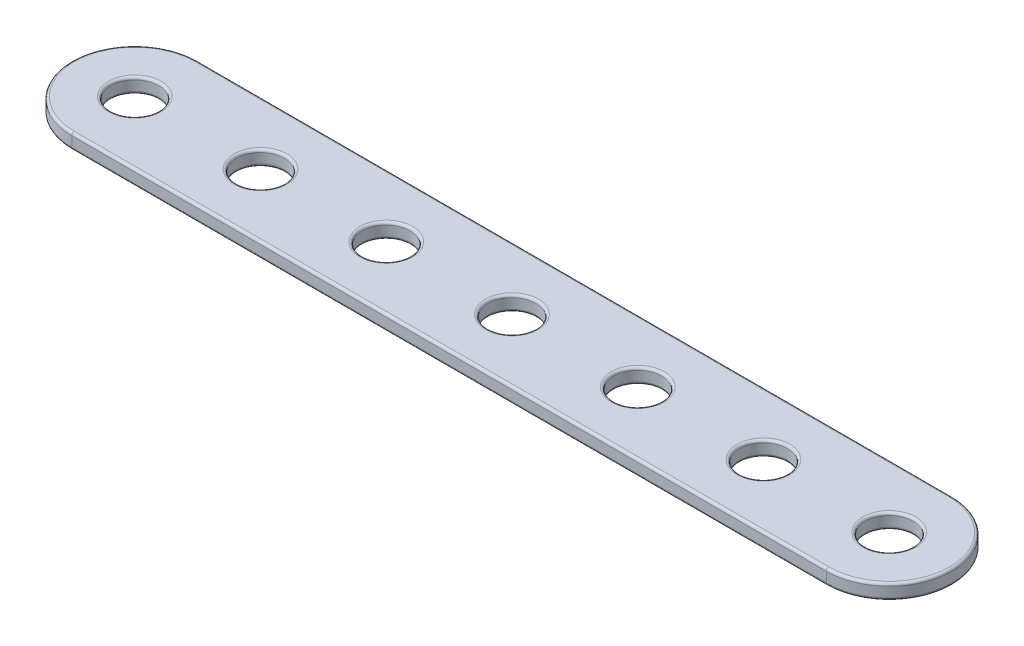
ISO-10303-21;
HEADER;
FILE_DESCRIPTION(('STEP AP214'),'2;1');
FILE_NAME('part.step','',(''),(''),'','','');
FILE_SCHEMA(('AUTOMOTIVE_DESIGN { 1 0 10303 214 1 1 1 1 }'));
ENDSEC;
DATA;
#1=APPLICATION_CONTEXT('core data for automotive mechanical design processes');
#2=APPLICATION_PROTOCOL_DEFINITION('international standard','automotive_design',2000,#1);
#3=PRODUCT_CONTEXT('',#1,'mechanical');
#4=PRODUCT('Part','Part','',(#3));
#5=PRODUCT_RELATED_PRODUCT_CATEGORY('part','',(#4));
#6=PRODUCT_DEFINITION_FORMATION('','',#4);
#7=PRODUCT_DEFINITION_CONTEXT('part definition',#1,'design');
#8=PRODUCT_DEFINITION('design','',#6,#7);
#9=PRODUCT_DEFINITION_SHAPE('','',#8);
#10=(LENGTH_UNIT() NAMED_UNIT(*) SI_UNIT(.MILLI.,.METRE.));
#11=(NAMED_UNIT(*) PLANE_ANGLE_UNIT() SI_UNIT($,.RADIAN.));
#12=(NAMED_UNIT(*) SI_UNIT($,.STERADIAN.) SOLID_ANGLE_UNIT());
#13=UNCERTAINTY_MEASURE_WITH_UNIT(LENGTH_MEASURE(1.E-05),#10,'distance_accuracy_value','');
#14=(GEOMETRIC_REPRESENTATION_CONTEXT(3) GLOBAL_UNCERTAINTY_ASSIGNED_CONTEXT((#13)) GLOBAL_UNIT_ASSIGNED_CONTEXT((#10,
#11,#12)) REPRESENTATION_CONTEXT('',''));
#15=CARTESIAN_POINT('',(0.,0.,0.));
#16=DIRECTION('',(0.,0.,1.));
#17=DIRECTION('',(1.,0.,0.));
#18=AXIS2_PLACEMENT_3D('',#15,#16,#17);
#19=CARTESIAN_POINT('',(0.,1.524,-6.35));
#20=DIRECTION('',(0.,-1.,0.));
#21=DIRECTION('',(0.,0.,-1.));
#22=AXIS2_PLACEMENT_3D('',#19,#20,#21);
#23=CYLINDRICAL_SURFACE('',#22,6.35);
#24=DIRECTION('',(0.,-1.,0.));
#25=VECTOR('',#24,1.);
#26=CARTESIAN_POINT('',(0.,1.524,-12.7));
#27=LINE('',#26,#25);
#28=CARTESIAN_POINT('',(0.,1.27,-12.7));
#29=VERTEX_POINT('',#28);
#30=CARTESIAN_POINT('',(0.,0.254000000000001,-12.7));
#31=VERTEX_POINT('',#30);
#32=EDGE_CURVE('E136',#29,#31,#27,.T.);
#33=ORIENTED_EDGE('',*,*,#32,.T.);
#34=CARTESIAN_POINT('',(0.,0.254,-6.35));
#35=DIRECTION('',(0.,1.,0.));
#36=DIRECTION('',(0.,0.,1.));
#37=AXIS2_PLACEMENT_3D('',#34,#35,#36);
#38=CIRCLE('',#37,6.35);
#39=CARTESIAN_POINT('',(0.,0.254000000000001,0.));
#40=VERTEX_POINT('',#39);
#41=EDGE_CURVE('E178',#31,#40,#38,.T.);
#42=ORIENTED_EDGE('',*,*,#41,.T.);
#43=DIRECTION('',(0.,-1.,0.));
#44=VECTOR('',#43,1.);
#45=CARTESIAN_POINT('',(0.,1.524,0.));
#46=LINE('',#45,#44);
#47=CARTESIAN_POINT('',(0.,1.27,0.));
#48=VERTEX_POINT('',#47);
#49=EDGE_CURVE('E110',#48,#40,#46,.T.);
#50=ORIENTED_EDGE('',*,*,#49,.F.);
#51=CARTESIAN_POINT('',(0.,1.27,-6.35));
#52=DIRECTION('',(0.,1.,0.));
#53=DIRECTION('',(0.,0.,1.));
#54=AXIS2_PLACEMENT_3D('',#51,#52,#53);
#55=CIRCLE('',#54,6.35);
#56=EDGE_CURVE('E176',#48,#29,#55,.F.);
#57=ORIENTED_EDGE('',*,*,#56,.T.);
#58=EDGE_LOOP('',(#33,#42,#50,#57));
#59=FACE_BOUND('',#58,.T.);
#60=ADVANCED_FACE('F26',(#59),#23,.T.);
#61=CARTESIAN_POINT('',(0.,1.524,0.));
#62=DIRECTION('',(0.,0.,-1.));
#63=DIRECTION('',(-1.,0.,0.));
#64=AXIS2_PLACEMENT_3D('',#61,#62,#63);
#65=PLANE('',#64);
#66=ORIENTED_EDGE('',*,*,#49,.T.);
#67=DIRECTION('',(1.,0.,0.));
#68=VECTOR('',#67,1.);
#69=CARTESIAN_POINT('',(0.,0.254,0.));
#70=LINE('',#69,#68);
#71=CARTESIAN_POINT('',(76.2,0.254000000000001,0.));
#72=VERTEX_POINT('',#71);
#73=EDGE_CURVE('E109',#40,#72,#70,.T.);
#74=ORIENTED_EDGE('',*,*,#73,.T.);
#75=DIRECTION('',(0.,-1.,0.));
#76=VECTOR('',#75,1.);
#77=CARTESIAN_POINT('',(76.2,1.524,0.));
#78=LINE('',#77,#76);
#79=CARTESIAN_POINT('',(76.2,1.27,0.));
#80=VERTEX_POINT('',#79);
#81=EDGE_CURVE('E92',#80,#72,#78,.T.);
#82=ORIENTED_EDGE('',*,*,#81,.F.);
#83=DIRECTION('',(1.,0.,0.));
#84=VECTOR('',#83,1.);
#85=CARTESIAN_POINT('',(0.,1.27,0.));
#86=LINE('',#85,#84);
#87=EDGE_CURVE('E106',#80,#48,#86,.F.);
#88=ORIENTED_EDGE('',*,*,#87,.T.);
#89=EDGE_LOOP('',(#66,#74,#82,#88));
#90=FACE_BOUND('',#89,.T.);
#91=ADVANCED_FACE('F105',(#90),#65,.F.);
#92=CARTESIAN_POINT('',(76.2,1.524,-6.35));
#93=DIRECTION('',(0.,-1.,0.));
#94=DIRECTION('',(0.,0.,-1.));
#95=AXIS2_PLACEMENT_3D('',#92,#93,#94);
#96=CYLINDRICAL_SURFACE('',#95,6.35);
#97=ORIENTED_EDGE('',*,*,#81,.T.);
#98=CARTESIAN_POINT('',(76.2,0.254,-6.35));
#99=DIRECTION('',(0.,1.,0.));
#100=DIRECTION('',(0.,0.,1.));
#101=AXIS2_PLACEMENT_3D('',#98,#99,#100);
#102=CIRCLE('',#101,6.35);
#103=CARTESIAN_POINT('',(76.2,0.254000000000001,-12.7));
#104=VERTEX_POINT('',#103);
#105=EDGE_CURVE('E98',#72,#104,#102,.T.);
#106=ORIENTED_EDGE('',*,*,#105,.T.);
#107=DIRECTION('',(0.,-1.,0.));
#108=VECTOR('',#107,1.);
#109=CARTESIAN_POINT('',(76.2,1.524,-12.7));
#110=LINE('',#109,#108);
#111=CARTESIAN_POINT('',(76.2,1.27,-12.7));
#112=VERTEX_POINT('',#111);
#113=EDGE_CURVE('E94',#112,#104,#110,.T.);
#114=ORIENTED_EDGE('',*,*,#113,.F.);
#115=CARTESIAN_POINT('',(76.2,1.27,-6.35));
#116=DIRECTION('',(0.,1.,0.));
#117=DIRECTION('',(0.,0.,1.));
#118=AXIS2_PLACEMENT_3D('',#115,#116,#117);
#119=CIRCLE('',#118,6.35);
#120=EDGE_CURVE('E89',#112,#80,#119,.F.);
#121=ORIENTED_EDGE('',*,*,#120,.T.);
#122=EDGE_LOOP('',(#97,#106,#114,#121));
#123=FACE_BOUND('',#122,.T.);
#124=ADVANCED_FACE('F91',(#123),#96,.T.);
#125=CARTESIAN_POINT('',(0.,1.524,-12.7));
#126=DIRECTION('',(0.,0.,1.));
#127=DIRECTION('',(1.,0.,0.));
#128=AXIS2_PLACEMENT_3D('',#125,#126,#127);
#129=PLANE('',#128);
#130=ORIENTED_EDGE('',*,*,#113,.T.);
#131=DIRECTION('',(-1.,0.,0.));
#132=VECTOR('',#131,1.);
#133=CARTESIAN_POINT('',(0.,0.254,-12.7));
#134=LINE('',#133,#132);
#135=EDGE_CURVE('E174',#104,#31,#134,.T.);
#136=ORIENTED_EDGE('',*,*,#135,.T.);
#137=ORIENTED_EDGE('',*,*,#32,.F.);
#138=DIRECTION('',(-1.,0.,0.));
#139=VECTOR('',#138,1.);
#140=CARTESIAN_POINT('',(76.2,1.27,-12.7));
#141=LINE('',#140,#139);
#142=EDGE_CURVE('E172',#29,#112,#141,.F.);
#143=ORIENTED_EDGE('',*,*,#142,.T.);
#144=EDGE_LOOP('',(#130,#136,#137,#143));
#145=FACE_BOUND('',#144,.T.);
#146=ADVANCED_FACE('F258',(#145),#129,.F.);
#147=CARTESIAN_POINT('',(0.,1.524,-6.35));
#148=DIRECTION('',(0.,1.,0.));
#149=DIRECTION('',(0.,0.,1.));
#150=AXIS2_PLACEMENT_3D('',#147,#148,#149);
#151=PLANE('',#150);
#152=CARTESIAN_POINT('',(76.2,1.524,-6.35));
#153=DIRECTION('',(0.,1.,0.));
#154=DIRECTION('',(0.,0.,1.));
#155=AXIS2_PLACEMENT_3D('',#152,#153,#154);
#156=CIRCLE('',#155,6.096);
#157=CARTESIAN_POINT('',(76.2,1.524,-0.254));
#158=VERTEX_POINT('',#157);
#159=CARTESIAN_POINT('',(76.2,1.524,-12.446));
#160=VERTEX_POINT('',#159);
#161=EDGE_CURVE('E33',#158,#160,#156,.T.);
#162=ORIENTED_EDGE('',*,*,#161,.T.);
#163=DIRECTION('',(-1.,0.,0.));
#164=VECTOR('',#163,1.);
#165=CARTESIAN_POINT('',(0.,1.524,-12.446));
#166=LINE('',#165,#164);
#167=CARTESIAN_POINT('',(0.,1.524,-12.446));
#168=VERTEX_POINT('',#167);
#169=EDGE_CURVE('E11',#160,#168,#166,.T.);
#170=ORIENTED_EDGE('',*,*,#169,.T.);
#171=CARTESIAN_POINT('',(0.,1.524,-6.35));
#172=DIRECTION('',(0.,1.,0.));
#173=DIRECTION('',(0.,0.,1.));
#174=AXIS2_PLACEMENT_3D('',#171,#172,#173);
#175=CIRCLE('',#174,6.096);
#176=CARTESIAN_POINT('',(0.,1.524,-0.254));
#177=VERTEX_POINT('',#176);
#178=EDGE_CURVE('E243',#168,#177,#175,.T.);
#179=ORIENTED_EDGE('',*,*,#178,.T.);
#180=DIRECTION('',(1.,0.,0.));
#181=VECTOR('',#180,1.);
#182=CARTESIAN_POINT('',(76.2,1.524,-0.254));
#183=LINE('',#182,#181);
#184=EDGE_CURVE('E43',#177,#158,#183,.T.);
#185=ORIENTED_EDGE('',*,*,#184,.T.);
#186=EDGE_LOOP('',(#162,#170,#179,#185));
#187=FACE_BOUND('',#186,.T.);
#188=CARTESIAN_POINT('',(0.,1.524,-6.35));
#189=DIRECTION('',(0.,1.,0.));
#190=DIRECTION('',(0.,0.,1.));
#191=AXIS2_PLACEMENT_3D('',#188,#189,#190);
#192=CIRCLE('',#191,2.667);
#193=CARTESIAN_POINT('',(0.,1.524,-3.683));
#194=VERTEX_POINT('',#193);
#195=EDGE_CURVE('E240',#194,#194,#192,.F.);
#196=ORIENTED_EDGE('',*,*,#195,.T.);
#197=EDGE_LOOP('',(#196));
#198=FACE_BOUND('',#197,.T.);
#199=CARTESIAN_POINT('',(12.7,1.524,-6.35));
#200=DIRECTION('',(0.,1.,0.));
#201=DIRECTION('',(0.,0.,1.));
#202=AXIS2_PLACEMENT_3D('',#199,#200,#201);
#203=CIRCLE('',#202,2.667);
#204=CARTESIAN_POINT('',(12.7,1.524,-3.683));
#205=VERTEX_POINT('',#204);
#206=EDGE_CURVE('E237',#205,#205,#203,.F.);
#207=ORIENTED_EDGE('',*,*,#206,.T.);
#208=EDGE_LOOP('',(#207));
#209=FACE_BOUND('',#208,.T.);
#210=CARTESIAN_POINT('',(25.4,1.524,-6.35));
#211=DIRECTION('',(0.,1.,0.));
#212=DIRECTION('',(0.,0.,1.));
#213=AXIS2_PLACEMENT_3D('',#210,#211,#212);
#214=CIRCLE('',#213,2.667);
#215=CARTESIAN_POINT('',(25.4,1.524,-3.683));
#216=VERTEX_POINT('',#215);
#217=EDGE_CURVE('E234',#216,#216,#214,.F.);
#218=ORIENTED_EDGE('',*,*,#217,.T.);
#219=EDGE_LOOP('',(#218));
#220=FACE_BOUND('',#219,.T.);
#221=CARTESIAN_POINT('',(38.1,1.524,-6.35));
#222=DIRECTION('',(0.,1.,0.));
#223=DIRECTION('',(0.,0.,1.));
#224=AXIS2_PLACEMENT_3D('',#221,#222,#223);
#225=CIRCLE('',#224,2.667);
#226=CARTESIAN_POINT('',(38.1,1.524,-3.683));
#227=VERTEX_POINT('',#226);
#228=EDGE_CURVE('E231',#227,#227,#225,.F.);
#229=ORIENTED_EDGE('',*,*,#228,.T.);
#230=EDGE_LOOP('',(#229));
#231=FACE_BOUND('',#230,.T.);
#232=CARTESIAN_POINT('',(50.8,1.524,-6.35));
#233=DIRECTION('',(0.,1.,0.));
#234=DIRECTION('',(0.,0.,1.));
#235=AXIS2_PLACEMENT_3D('',#232,#233,#234);
#236=CIRCLE('',#235,2.667);
#237=CARTESIAN_POINT('',(50.8,1.524,-3.683));
#238=VERTEX_POINT('',#237);
#239=EDGE_CURVE('E228',#238,#238,#236,.F.);
#240=ORIENTED_EDGE('',*,*,#239,.T.);
#241=EDGE_LOOP('',(#240));
#242=FACE_BOUND('',#241,.T.);
#243=CARTESIAN_POINT('',(63.5,1.524,-6.35));
#244=DIRECTION('',(0.,1.,0.));
#245=DIRECTION('',(0.,0.,1.));
#246=AXIS2_PLACEMENT_3D('',#243,#244,#245);
#247=CIRCLE('',#246,2.667);
#248=CARTESIAN_POINT('',(63.5,1.524,-3.683));
#249=VERTEX_POINT('',#248);
#250=EDGE_CURVE('E225',#249,#249,#247,.F.);
#251=ORIENTED_EDGE('',*,*,#250,.T.);
#252=EDGE_LOOP('',(#251));
#253=FACE_BOUND('',#252,.T.);
#254=CARTESIAN_POINT('',(76.2,1.524,-6.35));
#255=DIRECTION('',(0.,1.,0.));
#256=DIRECTION('',(0.,0.,1.));
#257=AXIS2_PLACEMENT_3D('',#254,#255,#256);
#258=CIRCLE('',#257,2.667);
#259=CARTESIAN_POINT('',(76.2,1.524,-3.683));
#260=VERTEX_POINT('',#259);
#261=EDGE_CURVE('E222',#260,#260,#258,.F.);
#262=ORIENTED_EDGE('',*,*,#261,.T.);
#263=EDGE_LOOP('',(#262));
#264=FACE_BOUND('',#263,.T.);
#265=ADVANCED_FACE('F246',(#187,#198,#209,#220,#231,#242,#253,#264),#151,.T.);
#266=CARTESIAN_POINT('',(0.,0.,-6.35));
#267=DIRECTION('',(0.,1.,0.));
#268=DIRECTION('',(0.,0.,1.));
#269=AXIS2_PLACEMENT_3D('',#266,#267,#268);
#270=PLANE('',#269);
#271=CARTESIAN_POINT('',(76.2,0.,-6.35));
#272=DIRECTION('',(0.,1.,0.));
#273=DIRECTION('',(0.,0.,1.));
#274=AXIS2_PLACEMENT_3D('',#271,#272,#273);
#275=CIRCLE('',#274,6.096);
#276=CARTESIAN_POINT('',(76.2,0.,-12.446));
#277=VERTEX_POINT('',#276);
#278=CARTESIAN_POINT('',(76.2,0.,-0.254));
#279=VERTEX_POINT('',#278);
#280=EDGE_CURVE('E167',#277,#279,#275,.F.);
#281=ORIENTED_EDGE('',*,*,#280,.T.);
#282=DIRECTION('',(1.,0.,0.));
#283=VECTOR('',#282,1.);
#284=CARTESIAN_POINT('',(0.,0.,-0.254));
#285=LINE('',#284,#283);
#286=CARTESIAN_POINT('',(0.,0.,-0.254));
#287=VERTEX_POINT('',#286);
#288=EDGE_CURVE('E99',#279,#287,#285,.F.);
#289=ORIENTED_EDGE('',*,*,#288,.T.);
#290=CARTESIAN_POINT('',(0.,0.,-6.35));
#291=DIRECTION('',(0.,1.,0.));
#292=DIRECTION('',(0.,0.,1.));
#293=AXIS2_PLACEMENT_3D('',#290,#291,#292);
#294=CIRCLE('',#293,6.096);
#295=CARTESIAN_POINT('',(0.,0.,-12.446));
#296=VERTEX_POINT('',#295);
#297=EDGE_CURVE('E163',#287,#296,#294,.F.);
#298=ORIENTED_EDGE('',*,*,#297,.T.);
#299=DIRECTION('',(-1.,0.,0.));
#300=VECTOR('',#299,1.);
#301=CARTESIAN_POINT('',(0.,0.,-12.446));
#302=LINE('',#301,#300);
#303=EDGE_CURVE('E165',#296,#277,#302,.F.);
#304=ORIENTED_EDGE('',*,*,#303,.T.);
#305=EDGE_LOOP('',(#281,#289,#298,#304));
#306=FACE_BOUND('',#305,.T.);
#307=CARTESIAN_POINT('',(0.,0.,-6.35));
#308=DIRECTION('',(0.,1.,0.));
#309=DIRECTION('',(0.,0.,1.));
#310=AXIS2_PLACEMENT_3D('',#307,#308,#309);
#311=CIRCLE('',#310,2.667);
#312=CARTESIAN_POINT('',(0.,0.,-3.683));
#313=VERTEX_POINT('',#312);
#314=EDGE_CURVE('E160',#313,#313,#311,.T.);
#315=ORIENTED_EDGE('',*,*,#314,.T.);
#316=EDGE_LOOP('',(#315));
#317=FACE_BOUND('',#316,.T.);
#318=CARTESIAN_POINT('',(12.7,0.,-6.35));
#319=DIRECTION('',(0.,1.,0.));
#320=DIRECTION('',(0.,0.,1.));
#321=AXIS2_PLACEMENT_3D('',#318,#319,#320);
#322=CIRCLE('',#321,2.667);
#323=CARTESIAN_POINT('',(12.7,0.,-3.683));
#324=VERTEX_POINT('',#323);
#325=EDGE_CURVE('E157',#324,#324,#322,.T.);
#326=ORIENTED_EDGE('',*,*,#325,.T.);
#327=EDGE_LOOP('',(#326));
#328=FACE_BOUND('',#327,.T.);
#329=CARTESIAN_POINT('',(25.4,0.,-6.35));
#330=DIRECTION('',(0.,1.,0.));
#331=DIRECTION('',(0.,0.,1.));
#332=AXIS2_PLACEMENT_3D('',#329,#330,#331);
#333=CIRCLE('',#332,2.667);
#334=CARTESIAN_POINT('',(25.4,0.,-3.683));
#335=VERTEX_POINT('',#334);
#336=EDGE_CURVE('E154',#335,#335,#333,.T.);
#337=ORIENTED_EDGE('',*,*,#336,.T.);
#338=EDGE_LOOP('',(#337));
#339=FACE_BOUND('',#338,.T.);
#340=CARTESIAN_POINT('',(38.1,0.,-6.35));
#341=DIRECTION('',(0.,1.,0.));
#342=DIRECTION('',(0.,0.,1.));
#343=AXIS2_PLACEMENT_3D('',#340,#341,#342);
#344=CIRCLE('',#343,2.667);
#345=CARTESIAN_POINT('',(38.1,0.,-3.683));
#346=VERTEX_POINT('',#345);
#347=EDGE_CURVE('E151',#346,#346,#344,.T.);
#348=ORIENTED_EDGE('',*,*,#347,.T.);
#349=EDGE_LOOP('',(#348));
#350=FACE_BOUND('',#349,.T.);
#351=CARTESIAN_POINT('',(50.8,0.,-6.35));
#352=DIRECTION('',(0.,1.,0.));
#353=DIRECTION('',(0.,0.,1.));
#354=AXIS2_PLACEMENT_3D('',#351,#352,#353);
#355=CIRCLE('',#354,2.667);
#356=CARTESIAN_POINT('',(50.8,0.,-3.683));
#357=VERTEX_POINT('',#356);
#358=EDGE_CURVE('E148',#357,#357,#355,.T.);
#359=ORIENTED_EDGE('',*,*,#358,.T.);
#360=EDGE_LOOP('',(#359));
#361=FACE_BOUND('',#360,.T.);
#362=CARTESIAN_POINT('',(63.5,0.,-6.35));
#363=DIRECTION('',(0.,1.,0.));
#364=DIRECTION('',(0.,0.,1.));
#365=AXIS2_PLACEMENT_3D('',#362,#363,#364);
#366=CIRCLE('',#365,2.667);
#367=CARTESIAN_POINT('',(63.5,0.,-3.683));
#368=VERTEX_POINT('',#367);
#369=EDGE_CURVE('E145',#368,#368,#366,.T.);
#370=ORIENTED_EDGE('',*,*,#369,.T.);
#371=EDGE_LOOP('',(#370));
#372=FACE_BOUND('',#371,.T.);
#373=CARTESIAN_POINT('',(76.2,0.,-6.35));
#374=DIRECTION('',(0.,1.,0.));
#375=DIRECTION('',(0.,0.,1.));
#376=AXIS2_PLACEMENT_3D('',#373,#374,#375);
#377=CIRCLE('',#376,2.667);
#378=CARTESIAN_POINT('',(76.2,0.,-3.683));
#379=VERTEX_POINT('',#378);
#380=EDGE_CURVE('E142',#379,#379,#377,.T.);
#381=ORIENTED_EDGE('',*,*,#380,.T.);
#382=EDGE_LOOP('',(#381));
#383=FACE_BOUND('',#382,.T.);
#384=ADVANCED_FACE('F287',(#306,#317,#328,#339,#350,#361,#372,#383),#270,.F.);
#385=CARTESIAN_POINT('',(0.,0.,-6.35));
#386=DIRECTION('',(0.,1.,0.));
#387=DIRECTION('',(0.,0.,1.));
#388=AXIS2_PLACEMENT_3D('',#385,#386,#387);
#389=CYLINDRICAL_SURFACE('',#388,2.413);
#390=CARTESIAN_POINT('',(0.,0.254,-6.35));
#391=DIRECTION('',(0.,1.,0.));
#392=DIRECTION('',(0.,0.,1.));
#393=AXIS2_PLACEMENT_3D('',#390,#391,#392);
#394=CIRCLE('',#393,2.413);
#395=CARTESIAN_POINT('',(0.,0.254,-3.937));
#396=VERTEX_POINT('',#395);
#397=EDGE_CURVE('E183',#396,#396,#394,.F.);
#398=CARTESIAN_POINT('',(0.,1.27,-6.35));
#399=DIRECTION('',(0.,1.,0.));
#400=DIRECTION('',(0.,0.,1.));
#401=AXIS2_PLACEMENT_3D('',#398,#399,#400);
#402=CIRCLE('',#401,2.413);
#403=CARTESIAN_POINT('',(0.,1.27,-3.937));
#404=VERTEX_POINT('',#403);
#405=EDGE_CURVE('E180',#404,#404,#402,.T.);
#406=CARTESIAN_POINT('',(0.,0.254,-3.937));
#407=CARTESIAN_POINT('',(0.,0.264583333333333,-3.937));
#408=CARTESIAN_POINT('',(0.,0.275166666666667,-3.937));
#409=CARTESIAN_POINT('',(0.,0.296333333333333,-3.937));
#410=CARTESIAN_POINT('',(0.,0.306916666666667,-3.937));
#411=CARTESIAN_POINT('',(0.,0.328083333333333,-3.937));
#412=CARTESIAN_POINT('',(0.,0.338666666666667,-3.937));
#413=CARTESIAN_POINT('',(0.,0.359833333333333,-3.937));
#414=CARTESIAN_POINT('',(0.,0.370416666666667,-3.937));
#415=CARTESIAN_POINT('',(0.,0.391583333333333,-3.937));
#416=CARTESIAN_POINT('',(0.,0.402166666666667,-3.937));
#417=CARTESIAN_POINT('',(0.,0.423333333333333,-3.937));
#418=CARTESIAN_POINT('',(0.,0.433916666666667,-3.937));
#419=CARTESIAN_POINT('',(0.,0.455083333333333,-3.937));
#420=CARTESIAN_POINT('',(0.,0.465666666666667,-3.937));
#421=CARTESIAN_POINT('',(0.,0.486833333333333,-3.937));
#422=CARTESIAN_POINT('',(0.,0.497416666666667,-3.937));
#423=CARTESIAN_POINT('',(0.,0.518583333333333,-3.937));
#424=CARTESIAN_POINT('',(0.,0.529166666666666,-3.937));
#425=CARTESIAN_POINT('',(0.,0.550333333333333,-3.937));
#426=CARTESIAN_POINT('',(0.,0.560916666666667,-3.937));
#427=CARTESIAN_POINT('',(0.,0.582083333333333,-3.937));
#428=CARTESIAN_POINT('',(0.,0.592666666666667,-3.937));
#429=CARTESIAN_POINT('',(0.,0.613833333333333,-3.937));
#430=CARTESIAN_POINT('',(0.,0.624416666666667,-3.937));
#431=CARTESIAN_POINT('',(0.,0.645583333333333,-3.937));
#432=CARTESIAN_POINT('',(0.,0.656166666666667,-3.937));
#433=CARTESIAN_POINT('',(0.,0.677333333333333,-3.937));
#434=CARTESIAN_POINT('',(0.,0.687916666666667,-3.937));
#435=CARTESIAN_POINT('',(0.,0.709083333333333,-3.937));
#436=CARTESIAN_POINT('',(0.,0.719666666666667,-3.937));
#437=CARTESIAN_POINT('',(0.,0.740833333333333,-3.937));
#438=CARTESIAN_POINT('',(0.,0.751416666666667,-3.937));
#439=CARTESIAN_POINT('',(0.,0.772583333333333,-3.937));
#440=CARTESIAN_POINT('',(0.,0.783166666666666,-3.937));
#441=CARTESIAN_POINT('',(0.,0.804333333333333,-3.937));
#442=CARTESIAN_POINT('',(0.,0.814916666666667,-3.937));
#443=CARTESIAN_POINT('',(0.,0.836083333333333,-3.937));
#444=CARTESIAN_POINT('',(0.,0.846666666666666,-3.937));
#445=CARTESIAN_POINT('',(0.,0.867833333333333,-3.937));
#446=CARTESIAN_POINT('',(0.,0.878416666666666,-3.937));
#447=CARTESIAN_POINT('',(0.,0.899583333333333,-3.937));
#448=CARTESIAN_POINT('',(0.,0.910166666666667,-3.937));
#449=CARTESIAN_POINT('',(0.,0.931333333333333,-3.937));
#450=CARTESIAN_POINT('',(0.,0.941916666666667,-3.937));
#451=CARTESIAN_POINT('',(0.,0.963083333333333,-3.937));
#452=CARTESIAN_POINT('',(0.,0.973666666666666,-3.937));
#453=CARTESIAN_POINT('',(0.,0.994833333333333,-3.937));
#454=CARTESIAN_POINT('',(0.,1.00541666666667,-3.937));
#455=CARTESIAN_POINT('',(0.,1.02658333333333,-3.937));
#456=CARTESIAN_POINT('',(0.,1.03716666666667,-3.937));
#457=CARTESIAN_POINT('',(0.,1.05833333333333,-3.937));
#458=CARTESIAN_POINT('',(0.,1.06891666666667,-3.937));
#459=CARTESIAN_POINT('',(0.,1.09008333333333,-3.937));
#460=CARTESIAN_POINT('',(0.,1.10066666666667,-3.937));
#461=CARTESIAN_POINT('',(0.,1.12183333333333,-3.937));
#462=CARTESIAN_POINT('',(0.,1.13241666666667,-3.937));
#463=CARTESIAN_POINT('',(0.,1.15358333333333,-3.937));
#464=CARTESIAN_POINT('',(0.,1.16416666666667,-3.937));
#465=CARTESIAN_POINT('',(0.,1.18533333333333,-3.937));
#466=CARTESIAN_POINT('',(0.,1.19591666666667,-3.937));
#467=CARTESIAN_POINT('',(0.,1.21708333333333,-3.937));
#468=CARTESIAN_POINT('',(0.,1.22766666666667,-3.937));
#469=CARTESIAN_POINT('',(0.,1.24883333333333,-3.937));
#470=CARTESIAN_POINT('',(0.,1.25941666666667,-3.937));
#471=CARTESIAN_POINT('',(0.,1.27,-3.937));
#472=B_SPLINE_CURVE_WITH_KNOTS('',3,(#406,#407,#408,#409,#410,#411,#412,#413,#414,#415,#416,
#417,#418,#419,#420,#421,#422,#423,#424,#425,#426,#427,#428,#429,#430,#431,#432,#433,#434,#435,
#436,#437,#438,#439,#440,#441,#442,#443,#444,#445,#446,#447,#448,#449,#450,#451,#452,#453,#454,
#455,#456,#457,#458,#459,#460,#461,#462,#463,#464,#465,#466,#467,#468,#469,#470,#471),
.UNSPECIFIED.,.F.,.F.,(4,2,2,2,2,2,2,2,2,2,2,2,2,2,2,2,2,2,2,2,2,2,2,2,2,2,2,2,2,2,2,2,4),(0.,
0.03175,0.0635,0.09525,0.127,0.15875,0.1905,0.22225,0.254,0.28575,0.3175,0.34925,0.381,0.41275,
0.4445,0.47625,0.508,0.53975,0.5715,0.60325,0.635,0.66675,0.6985,0.73025,0.762,0.79375,0.8255,
0.85725,0.889,0.92075,0.9525,0.98425,1.016),.UNSPECIFIED.);
#473=EDGE_CURVE('BSEAM290',#396,#404,#472,.T.);
#474=ORIENTED_EDGE('',*,*,#397,.T.);
#475=ORIENTED_EDGE('',*,*,#405,.T.);
#476=ORIENTED_EDGE('',*,*,#473,.T.);
#477=ORIENTED_EDGE('',*,*,#473,.F.);
#478=EDGE_LOOP('',(#474,#476,#475,#477));
#479=FACE_BOUND('',#478,.T.);
#480=ADVANCED_FACE('F290',(#479),#389,.F.);
#481=CARTESIAN_POINT('',(12.7,0.,-6.35));
#482=DIRECTION('',(0.,1.,0.));
#483=DIRECTION('',(0.,0.,1.));
#484=AXIS2_PLACEMENT_3D('',#481,#482,#483);
#485=CYLINDRICAL_SURFACE('',#484,2.413);
#486=CARTESIAN_POINT('',(12.7,0.254,-6.35));
#487=DIRECTION('',(0.,1.,0.));
#488=DIRECTION('',(0.,0.,1.));
#489=AXIS2_PLACEMENT_3D('',#486,#487,#488);
#490=CIRCLE('',#489,2.413);
#491=CARTESIAN_POINT('',(12.7,0.254,-3.937));
#492=VERTEX_POINT('',#491);
#493=EDGE_CURVE('E189',#492,#492,#490,.F.);
#494=CARTESIAN_POINT('',(12.7,1.27,-6.35));
#495=DIRECTION('',(0.,1.,0.));
#496=DIRECTION('',(0.,0.,1.));
#497=AXIS2_PLACEMENT_3D('',#494,#495,#496);
#498=CIRCLE('',#497,2.413);
#499=CARTESIAN_POINT('',(12.7,1.27,-3.937));
#500=VERTEX_POINT('',#499);
#501=EDGE_CURVE('E186',#500,#500,#498,.T.);
#502=CARTESIAN_POINT('',(12.7,0.254,-3.937));
#503=CARTESIAN_POINT('',(12.7,0.264583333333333,-3.937));
#504=CARTESIAN_POINT('',(12.7,0.275166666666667,-3.937));
#505=CARTESIAN_POINT('',(12.7,0.296333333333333,-3.937));
#506=CARTESIAN_POINT('',(12.7,0.306916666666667,-3.937));
#507=CARTESIAN_POINT('',(12.7,0.328083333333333,-3.937));
#508=CARTESIAN_POINT('',(12.7,0.338666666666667,-3.937));
#509=CARTESIAN_POINT('',(12.7,0.359833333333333,-3.937));
#510=CARTESIAN_POINT('',(12.7,0.370416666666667,-3.937));
#511=CARTESIAN_POINT('',(12.7,0.391583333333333,-3.937));
#512=CARTESIAN_POINT('',(12.7,0.402166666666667,-3.937));
#513=CARTESIAN_POINT('',(12.7,0.423333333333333,-3.937));
#514=CARTESIAN_POINT('',(12.7,0.433916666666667,-3.937));
#515=CARTESIAN_POINT('',(12.7,0.455083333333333,-3.937));
#516=CARTESIAN_POINT('',(12.7,0.465666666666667,-3.937));
#517=CARTESIAN_POINT('',(12.7,0.486833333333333,-3.937));
#518=CARTESIAN_POINT('',(12.7,0.497416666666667,-3.937));
#519=CARTESIAN_POINT('',(12.7,0.518583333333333,-3.937));
#520=CARTESIAN_POINT('',(12.7,0.529166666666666,-3.937));
#521=CARTESIAN_POINT('',(12.7,0.550333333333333,-3.937));
#522=CARTESIAN_POINT('',(12.7,0.560916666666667,-3.937));
#523=CARTESIAN_POINT('',(12.7,0.582083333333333,-3.937));
#524=CARTESIAN_POINT('',(12.7,0.592666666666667,-3.937));
#525=CARTESIAN_POINT('',(12.7,0.613833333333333,-3.937));
#526=CARTESIAN_POINT('',(12.7,0.624416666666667,-3.937));
#527=CARTESIAN_POINT('',(12.7,0.645583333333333,-3.937));
#528=CARTESIAN_POINT('',(12.7,0.656166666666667,-3.937));
#529=CARTESIAN_POINT('',(12.7,0.677333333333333,-3.937));
#530=CARTESIAN_POINT('',(12.7,0.687916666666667,-3.937));
#531=CARTESIAN_POINT('',(12.7,0.709083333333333,-3.937));
#532=CARTESIAN_POINT('',(12.7,0.719666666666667,-3.937));
#533=CARTESIAN_POINT('',(12.7,0.740833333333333,-3.937));
#534=CARTESIAN_POINT('',(12.7,0.751416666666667,-3.937));
#535=CARTESIAN_POINT('',(12.7,0.772583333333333,-3.937));
#536=CARTESIAN_POINT('',(12.7,0.783166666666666,-3.937));
#537=CARTESIAN_POINT('',(12.7,0.804333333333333,-3.937));
#538=CARTESIAN_POINT('',(12.7,0.814916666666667,-3.937));
#539=CARTESIAN_POINT('',(12.7,0.836083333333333,-3.937));
#540=CARTESIAN_POINT('',(12.7,0.846666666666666,-3.937));
#541=CARTESIAN_POINT('',(12.7,0.867833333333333,-3.937));
#542=CARTESIAN_POINT('',(12.7,0.878416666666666,-3.937));
#543=CARTESIAN_POINT('',(12.7,0.899583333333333,-3.937));
#544=CARTESIAN_POINT('',(12.7,0.910166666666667,-3.937));
#545=CARTESIAN_POINT('',(12.7,0.931333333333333,-3.937));
#546=CARTESIAN_POINT('',(12.7,0.941916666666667,-3.937));
#547=CARTESIAN_POINT('',(12.7,0.963083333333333,-3.937));
#548=CARTESIAN_POINT('',(12.7,0.973666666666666,-3.937));
#549=CARTESIAN_POINT('',(12.7,0.994833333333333,-3.937));
#550=CARTESIAN_POINT('',(12.7,1.00541666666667,-3.937));
#551=CARTESIAN_POINT('',(12.7,1.02658333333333,-3.937));
#552=CARTESIAN_POINT('',(12.7,1.03716666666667,-3.937));
#553=CARTESIAN_POINT('',(12.7,1.05833333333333,-3.937));
#554=CARTESIAN_POINT('',(12.7,1.06891666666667,-3.937));
#555=CARTESIAN_POINT('',(12.7,1.09008333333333,-3.937));
#556=CARTESIAN_POINT('',(12.7,1.10066666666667,-3.937));
#557=CARTESIAN_POINT('',(12.7,1.12183333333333,-3.937));
#558=CARTESIAN_POINT('',(12.7,1.13241666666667,-3.937));
#559=CARTESIAN_POINT('',(12.7,1.15358333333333,-3.937));
#560=CARTESIAN_POINT('',(12.7,1.16416666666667,-3.937));
#561=CARTESIAN_POINT('',(12.7,1.18533333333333,-3.937));
#562=CARTESIAN_POINT('',(12.7,1.19591666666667,-3.937));
#563=CARTESIAN_POINT('',(12.7,1.21708333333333,-3.937));
#564=CARTESIAN_POINT('',(12.7,1.22766666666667,-3.937));
#565=CARTESIAN_POINT('',(12.7,1.24883333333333,-3.937));
#566=CARTESIAN_POINT('',(12.7,1.25941666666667,-3.937));
#567=CARTESIAN_POINT('',(12.7,1.27,-3.937));
#568=B_SPLINE_CURVE_WITH_KNOTS('',3,(#502,#503,#504,#505,#506,#507,#508,#509,#510,#511,#512,
#513,#514,#515,#516,#517,#518,#519,#520,#521,#522,#523,#524,#525,#526,#527,#528,#529,#530,#531,
#532,#533,#534,#535,#536,#537,#538,#539,#540,#541,#542,#543,#544,#545,#546,#547,#548,#549,#550,
#551,#552,#553,#554,#555,#556,#557,#558,#559,#560,#561,#562,#563,#564,#565,#566,#567),
.UNSPECIFIED.,.F.,.F.,(4,2,2,2,2,2,2,2,2,2,2,2,2,2,2,2,2,2,2,2,2,2,2,2,2,2,2,2,2,2,2,2,4),(0.,
0.03175,0.0635,0.09525,0.127,0.15875,0.1905,0.22225,0.254,0.28575,0.3175,0.34925,0.381,0.41275,
0.4445,0.47625,0.508,0.53975,0.5715,0.60325,0.635,0.66675,0.6985,0.73025,0.762,0.79375,0.8255,
0.85725,0.889,0.92075,0.9525,0.98425,1.016),.UNSPECIFIED.);
#569=EDGE_CURVE('BSEAM294',#492,#500,#568,.T.);
#570=ORIENTED_EDGE('',*,*,#493,.T.);
#571=ORIENTED_EDGE('',*,*,#501,.T.);
#572=ORIENTED_EDGE('',*,*,#569,.T.);
#573=ORIENTED_EDGE('',*,*,#569,.F.);
#574=EDGE_LOOP('',(#570,#572,#571,#573));
#575=FACE_BOUND('',#574,.T.);
#576=ADVANCED_FACE('F294',(#575),#485,.F.);
#577=CARTESIAN_POINT('',(25.4,0.,-6.35));
#578=DIRECTION('',(0.,1.,0.));
#579=DIRECTION('',(0.,0.,1.));
#580=AXIS2_PLACEMENT_3D('',#577,#578,#579);
#581=CYLINDRICAL_SURFACE('',#580,2.413);
#582=CARTESIAN_POINT('',(25.4,0.254,-6.35));
#583=DIRECTION('',(0.,1.,0.));
#584=DIRECTION('',(0.,0.,1.));
#585=AXIS2_PLACEMENT_3D('',#582,#583,#584);
#586=CIRCLE('',#585,2.413);
#587=CARTESIAN_POINT('',(25.4,0.254,-3.937));
#588=VERTEX_POINT('',#587);
#589=EDGE_CURVE('E195',#588,#588,#586,.F.);
#590=CARTESIAN_POINT('',(25.4,1.27,-6.35));
#591=DIRECTION('',(0.,1.,0.));
#592=DIRECTION('',(0.,0.,1.));
#593=AXIS2_PLACEMENT_3D('',#590,#591,#592);
#594=CIRCLE('',#593,2.413);
#595=CARTESIAN_POINT('',(25.4,1.27,-3.937));
#596=VERTEX_POINT('',#595);
#597=EDGE_CURVE('E192',#596,#596,#594,.T.);
#598=CARTESIAN_POINT('',(25.4,0.254,-3.937));
#599=CARTESIAN_POINT('',(25.4,0.264583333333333,-3.937));
#600=CARTESIAN_POINT('',(25.4,0.275166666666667,-3.937));
#601=CARTESIAN_POINT('',(25.4,0.296333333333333,-3.937));
#602=CARTESIAN_POINT('',(25.4,0.306916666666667,-3.937));
#603=CARTESIAN_POINT('',(25.4,0.328083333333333,-3.937));
#604=CARTESIAN_POINT('',(25.4,0.338666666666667,-3.937));
#605=CARTESIAN_POINT('',(25.4,0.359833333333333,-3.937));
#606=CARTESIAN_POINT('',(25.4,0.370416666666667,-3.937));
#607=CARTESIAN_POINT('',(25.4,0.391583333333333,-3.937));
#608=CARTESIAN_POINT('',(25.4,0.402166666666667,-3.937));
#609=CARTESIAN_POINT('',(25.4,0.423333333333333,-3.937));
#610=CARTESIAN_POINT('',(25.4,0.433916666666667,-3.937));
#611=CARTESIAN_POINT('',(25.4,0.455083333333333,-3.937));
#612=CARTESIAN_POINT('',(25.4,0.465666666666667,-3.937));
#613=CARTESIAN_POINT('',(25.4,0.486833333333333,-3.937));
#614=CARTESIAN_POINT('',(25.4,0.497416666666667,-3.937));
#615=CARTESIAN_POINT('',(25.4,0.518583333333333,-3.937));
#616=CARTESIAN_POINT('',(25.4,0.529166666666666,-3.937));
#617=CARTESIAN_POINT('',(25.4,0.550333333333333,-3.937));
#618=CARTESIAN_POINT('',(25.4,0.560916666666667,-3.937));
#619=CARTESIAN_POINT('',(25.4,0.582083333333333,-3.937));
#620=CARTESIAN_POINT('',(25.4,0.592666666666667,-3.937));
#621=CARTESIAN_POINT('',(25.4,0.613833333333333,-3.937));
#622=CARTESIAN_POINT('',(25.4,0.624416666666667,-3.937));
#623=CARTESIAN_POINT('',(25.4,0.645583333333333,-3.937));
#624=CARTESIAN_POINT('',(25.4,0.656166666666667,-3.937));
#625=CARTESIAN_POINT('',(25.4,0.677333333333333,-3.937));
#626=CARTESIAN_POINT('',(25.4,0.687916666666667,-3.937));
#627=CARTESIAN_POINT('',(25.4,0.709083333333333,-3.937));
#628=CARTESIAN_POINT('',(25.4,0.719666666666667,-3.937));
#629=CARTESIAN_POINT('',(25.4,0.740833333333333,-3.937));
#630=CARTESIAN_POINT('',(25.4,0.751416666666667,-3.937));
#631=CARTESIAN_POINT('',(25.4,0.772583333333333,-3.937));
#632=CARTESIAN_POINT('',(25.4,0.783166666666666,-3.937));
#633=CARTESIAN_POINT('',(25.4,0.804333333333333,-3.937));
#634=CARTESIAN_POINT('',(25.4,0.814916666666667,-3.937));
#635=CARTESIAN_POINT('',(25.4,0.836083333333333,-3.937));
#636=CARTESIAN_POINT('',(25.4,0.846666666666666,-3.937));
#637=CARTESIAN_POINT('',(25.4,0.867833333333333,-3.937));
#638=CARTESIAN_POINT('',(25.4,0.878416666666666,-3.937));
#639=CARTESIAN_POINT('',(25.4,0.899583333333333,-3.937));
#640=CARTESIAN_POINT('',(25.4,0.910166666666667,-3.937));
#641=CARTESIAN_POINT('',(25.4,0.931333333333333,-3.937));
#642=CARTESIAN_POINT('',(25.4,0.941916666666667,-3.937));
#643=CARTESIAN_POINT('',(25.4,0.963083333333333,-3.937));
#644=CARTESIAN_POINT('',(25.4,0.973666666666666,-3.937));
#645=CARTESIAN_POINT('',(25.4,0.994833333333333,-3.937));
#646=CARTESIAN_POINT('',(25.4,1.00541666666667,-3.937));
#647=CARTESIAN_POINT('',(25.4,1.02658333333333,-3.937));
#648=CARTESIAN_POINT('',(25.4,1.03716666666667,-3.937));
#649=CARTESIAN_POINT('',(25.4,1.05833333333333,-3.937));
#650=CARTESIAN_POINT('',(25.4,1.06891666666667,-3.937));
#651=CARTESIAN_POINT('',(25.4,1.09008333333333,-3.937));
#652=CARTESIAN_POINT('',(25.4,1.10066666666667,-3.937));
#653=CARTESIAN_POINT('',(25.4,1.12183333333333,-3.937));
#654=CARTESIAN_POINT('',(25.4,1.13241666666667,-3.937));
#655=CARTESIAN_POINT('',(25.4,1.15358333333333,-3.937));
#656=CARTESIAN_POINT('',(25.4,1.16416666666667,-3.937));
#657=CARTESIAN_POINT('',(25.4,1.18533333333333,-3.937));
#658=CARTESIAN_POINT('',(25.4,1.19591666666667,-3.937));
#659=CARTESIAN_POINT('',(25.4,1.21708333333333,-3.937));
#660=CARTESIAN_POINT('',(25.4,1.22766666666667,-3.937));
#661=CARTESIAN_POINT('',(25.4,1.24883333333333,-3.937));
#662=CARTESIAN_POINT('',(25.4,1.25941666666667,-3.937));
#663=CARTESIAN_POINT('',(25.4,1.27,-3.937));
#664=B_SPLINE_CURVE_WITH_KNOTS('',3,(#598,#599,#600,#601,#602,#603,#604,#605,#606,#607,#608,
#609,#610,#611,#612,#613,#614,#615,#616,#617,#618,#619,#620,#621,#622,#623,#624,#625,#626,#627,
#628,#629,#630,#631,#632,#633,#634,#635,#636,#637,#638,#639,#640,#641,#642,#643,#644,#645,#646,
#647,#648,#649,#650,#651,#652,#653,#654,#655,#656,#657,#658,#659,#660,#661,#662,#663),
.UNSPECIFIED.,.F.,.F.,(4,2,2,2,2,2,2,2,2,2,2,2,2,2,2,2,2,2,2,2,2,2,2,2,2,2,2,2,2,2,2,2,4),(0.,
0.03175,0.0635,0.09525,0.127,0.15875,0.1905,0.22225,0.254,0.28575,0.3175,0.34925,0.381,0.41275,
0.4445,0.47625,0.508,0.53975,0.5715,0.60325,0.635,0.66675,0.6985,0.73025,0.762,0.79375,0.8255,
0.85725,0.889,0.92075,0.9525,0.98425,1.016),.UNSPECIFIED.);
#665=EDGE_CURVE('BSEAM298',#588,#596,#664,.T.);
#666=ORIENTED_EDGE('',*,*,#589,.T.);
#667=ORIENTED_EDGE('',*,*,#597,.T.);
#668=ORIENTED_EDGE('',*,*,#665,.T.);
#669=ORIENTED_EDGE('',*,*,#665,.F.);
#670=EDGE_LOOP('',(#666,#668,#667,#669));
#671=FACE_BOUND('',#670,.T.);
#672=ADVANCED_FACE('F298',(#671),#581,.F.);
#673=CARTESIAN_POINT('',(38.1,0.,-6.35));
#674=DIRECTION('',(0.,1.,0.));
#675=DIRECTION('',(0.,0.,1.));
#676=AXIS2_PLACEMENT_3D('',#673,#674,#675);
#677=CYLINDRICAL_SURFACE('',#676,2.413);
#678=CARTESIAN_POINT('',(38.1,0.254,-6.35));
#679=DIRECTION('',(0.,1.,0.));
#680=DIRECTION('',(0.,0.,1.));
#681=AXIS2_PLACEMENT_3D('',#678,#679,#680);
#682=CIRCLE('',#681,2.413);
#683=CARTESIAN_POINT('',(38.1,0.254,-3.937));
#684=VERTEX_POINT('',#683);
#685=EDGE_CURVE('E201',#684,#684,#682,.F.);
#686=CARTESIAN_POINT('',(38.1,1.27,-6.35));
#687=DIRECTION('',(0.,1.,0.));
#688=DIRECTION('',(0.,0.,1.));
#689=AXIS2_PLACEMENT_3D('',#686,#687,#688);
#690=CIRCLE('',#689,2.413);
#691=CARTESIAN_POINT('',(38.1,1.27,-3.937));
#692=VERTEX_POINT('',#691);
#693=EDGE_CURVE('E198',#692,#692,#690,.T.);
#694=CARTESIAN_POINT('',(38.1,0.254,-3.937));
#695=CARTESIAN_POINT('',(38.1,0.264583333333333,-3.937));
#696=CARTESIAN_POINT('',(38.1,0.275166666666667,-3.937));
#697=CARTESIAN_POINT('',(38.1,0.296333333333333,-3.937));
#698=CARTESIAN_POINT('',(38.1,0.306916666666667,-3.937));
#699=CARTESIAN_POINT('',(38.1,0.328083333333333,-3.937));
#700=CARTESIAN_POINT('',(38.1,0.338666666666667,-3.937));
#701=CARTESIAN_POINT('',(38.1,0.359833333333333,-3.937));
#702=CARTESIAN_POINT('',(38.1,0.370416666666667,-3.937));
#703=CARTESIAN_POINT('',(38.1,0.391583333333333,-3.937));
#704=CARTESIAN_POINT('',(38.1,0.402166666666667,-3.937));
#705=CARTESIAN_POINT('',(38.1,0.423333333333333,-3.937));
#706=CARTESIAN_POINT('',(38.1,0.433916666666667,-3.937));
#707=CARTESIAN_POINT('',(38.1,0.455083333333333,-3.937));
#708=CARTESIAN_POINT('',(38.1,0.465666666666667,-3.937));
#709=CARTESIAN_POINT('',(38.1,0.486833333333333,-3.937));
#710=CARTESIAN_POINT('',(38.1,0.497416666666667,-3.937));
#711=CARTESIAN_POINT('',(38.1,0.518583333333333,-3.937));
#712=CARTESIAN_POINT('',(38.1,0.529166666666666,-3.937));
#713=CARTESIAN_POINT('',(38.1,0.550333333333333,-3.937));
#714=CARTESIAN_POINT('',(38.1,0.560916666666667,-3.937));
#715=CARTESIAN_POINT('',(38.1,0.582083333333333,-3.937));
#716=CARTESIAN_POINT('',(38.1,0.592666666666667,-3.937));
#717=CARTESIAN_POINT('',(38.1,0.613833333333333,-3.937));
#718=CARTESIAN_POINT('',(38.1,0.624416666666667,-3.937));
#719=CARTESIAN_POINT('',(38.1,0.645583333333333,-3.937));
#720=CARTESIAN_POINT('',(38.1,0.656166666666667,-3.937));
#721=CARTESIAN_POINT('',(38.1,0.677333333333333,-3.937));
#722=CARTESIAN_POINT('',(38.1,0.687916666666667,-3.937));
#723=CARTESIAN_POINT('',(38.1,0.709083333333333,-3.937));
#724=CARTESIAN_POINT('',(38.1,0.719666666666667,-3.937));
#725=CARTESIAN_POINT('',(38.1,0.740833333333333,-3.937));
#726=CARTESIAN_POINT('',(38.1,0.751416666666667,-3.937));
#727=CARTESIAN_POINT('',(38.1,0.772583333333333,-3.937));
#728=CARTESIAN_POINT('',(38.1,0.783166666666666,-3.937));
#729=CARTESIAN_POINT('',(38.1,0.804333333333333,-3.937));
#730=CARTESIAN_POINT('',(38.1,0.814916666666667,-3.937));
#731=CARTESIAN_POINT('',(38.1,0.836083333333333,-3.937));
#732=CARTESIAN_POINT('',(38.1,0.846666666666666,-3.937));
#733=CARTESIAN_POINT('',(38.1,0.867833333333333,-3.937));
#734=CARTESIAN_POINT('',(38.1,0.878416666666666,-3.937));
#735=CARTESIAN_POINT('',(38.1,0.899583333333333,-3.937));
#736=CARTESIAN_POINT('',(38.1,0.910166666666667,-3.937));
#737=CARTESIAN_POINT('',(38.1,0.931333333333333,-3.937));
#738=CARTESIAN_POINT('',(38.1,0.941916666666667,-3.937));
#739=CARTESIAN_POINT('',(38.1,0.963083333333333,-3.937));
#740=CARTESIAN_POINT('',(38.1,0.973666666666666,-3.937));
#741=CARTESIAN_POINT('',(38.1,0.994833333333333,-3.937));
#742=CARTESIAN_POINT('',(38.1,1.00541666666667,-3.937));
#743=CARTESIAN_POINT('',(38.1,1.02658333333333,-3.937));
#744=CARTESIAN_POINT('',(38.1,1.03716666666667,-3.937));
#745=CARTESIAN_POINT('',(38.1,1.05833333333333,-3.937));
#746=CARTESIAN_POINT('',(38.1,1.06891666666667,-3.937));
#747=CARTESIAN_POINT('',(38.1,1.09008333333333,-3.937));
#748=CARTESIAN_POINT('',(38.1,1.10066666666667,-3.937));
#749=CARTESIAN_POINT('',(38.1,1.12183333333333,-3.937));
#750=CARTESIAN_POINT('',(38.1,1.13241666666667,-3.937));
#751=CARTESIAN_POINT('',(38.1,1.15358333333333,-3.937));
#752=CARTESIAN_POINT('',(38.1,1.16416666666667,-3.937));
#753=CARTESIAN_POINT('',(38.1,1.18533333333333,-3.937));
#754=CARTESIAN_POINT('',(38.1,1.19591666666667,-3.937));
#755=CARTESIAN_POINT('',(38.1,1.21708333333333,-3.937));
#756=CARTESIAN_POINT('',(38.1,1.22766666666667,-3.937));
#757=CARTESIAN_POINT('',(38.1,1.24883333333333,-3.937));
#758=CARTESIAN_POINT('',(38.1,1.25941666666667,-3.937));
#759=CARTESIAN_POINT('',(38.1,1.27,-3.937));
#760=B_SPLINE_CURVE_WITH_KNOTS('',3,(#694,#695,#696,#697,#698,#699,#700,#701,#702,#703,#704,
#705,#706,#707,#708,#709,#710,#711,#712,#713,#714,#715,#716,#717,#718,#719,#720,#721,#722,#723,
#724,#725,#726,#727,#728,#729,#730,#731,#732,#733,#734,#735,#736,#737,#738,#739,#740,#741,#742,
#743,#744,#745,#746,#747,#748,#749,#750,#751,#752,#753,#754,#755,#756,#757,#758,#759),
.UNSPECIFIED.,.F.,.F.,(4,2,2,2,2,2,2,2,2,2,2,2,2,2,2,2,2,2,2,2,2,2,2,2,2,2,2,2,2,2,2,2,4),(0.,
0.03175,0.0635,0.09525,0.127,0.15875,0.1905,0.22225,0.254,0.28575,0.3175,0.34925,0.381,0.41275,
0.4445,0.47625,0.508,0.53975,0.5715,0.60325,0.635,0.66675,0.6985,0.73025,0.762,0.79375,0.8255,
0.85725,0.889,0.92075,0.9525,0.98425,1.016),.UNSPECIFIED.);
#761=EDGE_CURVE('BSEAM302',#684,#692,#760,.T.);
#762=ORIENTED_EDGE('',*,*,#685,.T.);
#763=ORIENTED_EDGE('',*,*,#693,.T.);
#764=ORIENTED_EDGE('',*,*,#761,.T.);
#765=ORIENTED_EDGE('',*,*,#761,.F.);
#766=EDGE_LOOP('',(#762,#764,#763,#765));
#767=FACE_BOUND('',#766,.T.);
#768=ADVANCED_FACE('F302',(#767),#677,.F.);
#769=CARTESIAN_POINT('',(50.8,0.,-6.35));
#770=DIRECTION('',(0.,1.,0.));
#771=DIRECTION('',(0.,0.,1.));
#772=AXIS2_PLACEMENT_3D('',#769,#770,#771);
#773=CYLINDRICAL_SURFACE('',#772,2.413);
#774=CARTESIAN_POINT('',(50.8,0.254,-6.35));
#775=DIRECTION('',(0.,1.,0.));
#776=DIRECTION('',(0.,0.,1.));
#777=AXIS2_PLACEMENT_3D('',#774,#775,#776);
#778=CIRCLE('',#777,2.413);
#779=CARTESIAN_POINT('',(50.8,0.254,-3.937));
#780=VERTEX_POINT('',#779);
#781=EDGE_CURVE('E207',#780,#780,#778,.F.);
#782=CARTESIAN_POINT('',(50.8,1.27,-6.35));
#783=DIRECTION('',(0.,1.,0.));
#784=DIRECTION('',(0.,0.,1.));
#785=AXIS2_PLACEMENT_3D('',#782,#783,#784);
#786=CIRCLE('',#785,2.413);
#787=CARTESIAN_POINT('',(50.8,1.27,-3.937));
#788=VERTEX_POINT('',#787);
#789=EDGE_CURVE('E204',#788,#788,#786,.T.);
#790=CARTESIAN_POINT('',(50.8,0.254,-3.937));
#791=CARTESIAN_POINT('',(50.8,0.264583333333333,-3.937));
#792=CARTESIAN_POINT('',(50.8,0.275166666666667,-3.937));
#793=CARTESIAN_POINT('',(50.8,0.296333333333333,-3.937));
#794=CARTESIAN_POINT('',(50.8,0.306916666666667,-3.937));
#795=CARTESIAN_POINT('',(50.8,0.328083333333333,-3.937));
#796=CARTESIAN_POINT('',(50.8,0.338666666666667,-3.937));
#797=CARTESIAN_POINT('',(50.8,0.359833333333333,-3.937));
#798=CARTESIAN_POINT('',(50.8,0.370416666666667,-3.937));
#799=CARTESIAN_POINT('',(50.8,0.391583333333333,-3.937));
#800=CARTESIAN_POINT('',(50.8,0.402166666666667,-3.937));
#801=CARTESIAN_POINT('',(50.8,0.423333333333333,-3.937));
#802=CARTESIAN_POINT('',(50.8,0.433916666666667,-3.937));
#803=CARTESIAN_POINT('',(50.8,0.455083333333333,-3.937));
#804=CARTESIAN_POINT('',(50.8,0.465666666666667,-3.937));
#805=CARTESIAN_POINT('',(50.8,0.486833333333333,-3.937));
#806=CARTESIAN_POINT('',(50.8,0.497416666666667,-3.937));
#807=CARTESIAN_POINT('',(50.8,0.518583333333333,-3.937));
#808=CARTESIAN_POINT('',(50.8,0.529166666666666,-3.937));
#809=CARTESIAN_POINT('',(50.8,0.550333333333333,-3.937));
#810=CARTESIAN_POINT('',(50.8,0.560916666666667,-3.937));
#811=CARTESIAN_POINT('',(50.8,0.582083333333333,-3.937));
#812=CARTESIAN_POINT('',(50.8,0.592666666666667,-3.937));
#813=CARTESIAN_POINT('',(50.8,0.613833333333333,-3.937));
#814=CARTESIAN_POINT('',(50.8,0.624416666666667,-3.937));
#815=CARTESIAN_POINT('',(50.8,0.645583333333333,-3.937));
#816=CARTESIAN_POINT('',(50.8,0.656166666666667,-3.937));
#817=CARTESIAN_POINT('',(50.8,0.677333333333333,-3.937));
#818=CARTESIAN_POINT('',(50.8,0.687916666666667,-3.937));
#819=CARTESIAN_POINT('',(50.8,0.709083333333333,-3.937));
#820=CARTESIAN_POINT('',(50.8,0.719666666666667,-3.937));
#821=CARTESIAN_POINT('',(50.8,0.740833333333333,-3.937));
#822=CARTESIAN_POINT('',(50.8,0.751416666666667,-3.937));
#823=CARTESIAN_POINT('',(50.8,0.772583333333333,-3.937));
#824=CARTESIAN_POINT('',(50.8,0.783166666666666,-3.937));
#825=CARTESIAN_POINT('',(50.8,0.804333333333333,-3.937));
#826=CARTESIAN_POINT('',(50.8,0.814916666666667,-3.937));
#827=CARTESIAN_POINT('',(50.8,0.836083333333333,-3.937));
#828=CARTESIAN_POINT('',(50.8,0.846666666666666,-3.937));
#829=CARTESIAN_POINT('',(50.8,0.867833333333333,-3.937));
#830=CARTESIAN_POINT('',(50.8,0.878416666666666,-3.937));
#831=CARTESIAN_POINT('',(50.8,0.899583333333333,-3.937));
#832=CARTESIAN_POINT('',(50.8,0.910166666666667,-3.937));
#833=CARTESIAN_POINT('',(50.8,0.931333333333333,-3.937));
#834=CARTESIAN_POINT('',(50.8,0.941916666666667,-3.937));
#835=CARTESIAN_POINT('',(50.8,0.963083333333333,-3.937));
#836=CARTESIAN_POINT('',(50.8,0.973666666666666,-3.937));
#837=CARTESIAN_POINT('',(50.8,0.994833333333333,-3.937));
#838=CARTESIAN_POINT('',(50.8,1.00541666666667,-3.937));
#839=CARTESIAN_POINT('',(50.8,1.02658333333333,-3.937));
#840=CARTESIAN_POINT('',(50.8,1.03716666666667,-3.937));
#841=CARTESIAN_POINT('',(50.8,1.05833333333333,-3.937));
#842=CARTESIAN_POINT('',(50.8,1.06891666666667,-3.937));
#843=CARTESIAN_POINT('',(50.8,1.09008333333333,-3.937));
#844=CARTESIAN_POINT('',(50.8,1.10066666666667,-3.937));
#845=CARTESIAN_POINT('',(50.8,1.12183333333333,-3.937));
#846=CARTESIAN_POINT('',(50.8,1.13241666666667,-3.937));
#847=CARTESIAN_POINT('',(50.8,1.15358333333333,-3.937));
#848=CARTESIAN_POINT('',(50.8,1.16416666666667,-3.937));
#849=CARTESIAN_POINT('',(50.8,1.18533333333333,-3.937));
#850=CARTESIAN_POINT('',(50.8,1.19591666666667,-3.937));
#851=CARTESIAN_POINT('',(50.8,1.21708333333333,-3.937));
#852=CARTESIAN_POINT('',(50.8,1.22766666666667,-3.937));
#853=CARTESIAN_POINT('',(50.8,1.24883333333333,-3.937));
#854=CARTESIAN_POINT('',(50.8,1.25941666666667,-3.937));
#855=CARTESIAN_POINT('',(50.8,1.27,-3.937));
#856=B_SPLINE_CURVE_WITH_KNOTS('',3,(#790,#791,#792,#793,#794,#795,#796,#797,#798,#799,#800,
#801,#802,#803,#804,#805,#806,#807,#808,#809,#810,#811,#812,#813,#814,#815,#816,#817,#818,#819,
#820,#821,#822,#823,#824,#825,#826,#827,#828,#829,#830,#831,#832,#833,#834,#835,#836,#837,#838,
#839,#840,#841,#842,#843,#844,#845,#846,#847,#848,#849,#850,#851,#852,#853,#854,#855),
.UNSPECIFIED.,.F.,.F.,(4,2,2,2,2,2,2,2,2,2,2,2,2,2,2,2,2,2,2,2,2,2,2,2,2,2,2,2,2,2,2,2,4),(0.,
0.03175,0.0635,0.09525,0.127,0.15875,0.1905,0.22225,0.254,0.28575,0.3175,0.34925,0.381,0.41275,
0.4445,0.47625,0.508,0.53975,0.5715,0.60325,0.635,0.66675,0.6985,0.73025,0.762,0.79375,0.8255,
0.85725,0.889,0.92075,0.9525,0.98425,1.016),.UNSPECIFIED.);
#857=EDGE_CURVE('BSEAM306',#780,#788,#856,.T.);
#858=ORIENTED_EDGE('',*,*,#781,.T.);
#859=ORIENTED_EDGE('',*,*,#789,.T.);
#860=ORIENTED_EDGE('',*,*,#857,.T.);
#861=ORIENTED_EDGE('',*,*,#857,.F.);
#862=EDGE_LOOP('',(#858,#860,#859,#861));
#863=FACE_BOUND('',#862,.T.);
#864=ADVANCED_FACE('F306',(#863),#773,.F.);
#865=CARTESIAN_POINT('',(63.5,0.,-6.35));
#866=DIRECTION('',(0.,1.,0.));
#867=DIRECTION('',(0.,0.,1.));
#868=AXIS2_PLACEMENT_3D('',#865,#866,#867);
#869=CYLINDRICAL_SURFACE('',#868,2.413);
#870=CARTESIAN_POINT('',(63.5,0.254,-6.35));
#871=DIRECTION('',(0.,1.,0.));
#872=DIRECTION('',(0.,0.,1.));
#873=AXIS2_PLACEMENT_3D('',#870,#871,#872);
#874=CIRCLE('',#873,2.413);
#875=CARTESIAN_POINT('',(63.5,0.254,-3.937));
#876=VERTEX_POINT('',#875);
#877=EDGE_CURVE('E213',#876,#876,#874,.F.);
#878=CARTESIAN_POINT('',(63.5,1.27,-6.35));
#879=DIRECTION('',(0.,1.,0.));
#880=DIRECTION('',(0.,0.,1.));
#881=AXIS2_PLACEMENT_3D('',#878,#879,#880);
#882=CIRCLE('',#881,2.413);
#883=CARTESIAN_POINT('',(63.5,1.27,-3.937));
#884=VERTEX_POINT('',#883);
#885=EDGE_CURVE('E210',#884,#884,#882,.T.);
#886=CARTESIAN_POINT('',(63.5,0.254,-3.937));
#887=CARTESIAN_POINT('',(63.5,0.264583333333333,-3.937));
#888=CARTESIAN_POINT('',(63.5,0.275166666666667,-3.937));
#889=CARTESIAN_POINT('',(63.5,0.296333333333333,-3.937));
#890=CARTESIAN_POINT('',(63.5,0.306916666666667,-3.937));
#891=CARTESIAN_POINT('',(63.5,0.328083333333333,-3.937));
#892=CARTESIAN_POINT('',(63.5,0.338666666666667,-3.937));
#893=CARTESIAN_POINT('',(63.5,0.359833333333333,-3.937));
#894=CARTESIAN_POINT('',(63.5,0.370416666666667,-3.937));
#895=CARTESIAN_POINT('',(63.5,0.391583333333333,-3.937));
#896=CARTESIAN_POINT('',(63.5,0.402166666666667,-3.937));
#897=CARTESIAN_POINT('',(63.5,0.423333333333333,-3.937));
#898=CARTESIAN_POINT('',(63.5,0.433916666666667,-3.937));
#899=CARTESIAN_POINT('',(63.5,0.455083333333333,-3.937));
#900=CARTESIAN_POINT('',(63.5,0.465666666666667,-3.937));
#901=CARTESIAN_POINT('',(63.5,0.486833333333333,-3.937));
#902=CARTESIAN_POINT('',(63.5,0.497416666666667,-3.937));
#903=CARTESIAN_POINT('',(63.5,0.518583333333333,-3.937));
#904=CARTESIAN_POINT('',(63.5,0.529166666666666,-3.937));
#905=CARTESIAN_POINT('',(63.5,0.550333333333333,-3.937));
#906=CARTESIAN_POINT('',(63.5,0.560916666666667,-3.937));
#907=CARTESIAN_POINT('',(63.5,0.582083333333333,-3.937));
#908=CARTESIAN_POINT('',(63.5,0.592666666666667,-3.937));
#909=CARTESIAN_POINT('',(63.5,0.613833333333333,-3.937));
#910=CARTESIAN_POINT('',(63.5,0.624416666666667,-3.937));
#911=CARTESIAN_POINT('',(63.5,0.645583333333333,-3.937));
#912=CARTESIAN_POINT('',(63.5,0.656166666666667,-3.937));
#913=CARTESIAN_POINT('',(63.5,0.677333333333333,-3.937));
#914=CARTESIAN_POINT('',(63.5,0.687916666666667,-3.937));
#915=CARTESIAN_POINT('',(63.5,0.709083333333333,-3.937));
#916=CARTESIAN_POINT('',(63.5,0.719666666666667,-3.937));
#917=CARTESIAN_POINT('',(63.5,0.740833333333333,-3.937));
#918=CARTESIAN_POINT('',(63.5,0.751416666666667,-3.937));
#919=CARTESIAN_POINT('',(63.5,0.772583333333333,-3.937));
#920=CARTESIAN_POINT('',(63.5,0.783166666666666,-3.937));
#921=CARTESIAN_POINT('',(63.5,0.804333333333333,-3.937));
#922=CARTESIAN_POINT('',(63.5,0.814916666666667,-3.937));
#923=CARTESIAN_POINT('',(63.5,0.836083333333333,-3.937));
#924=CARTESIAN_POINT('',(63.5,0.846666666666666,-3.937));
#925=CARTESIAN_POINT('',(63.5,0.867833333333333,-3.937));
#926=CARTESIAN_POINT('',(63.5,0.878416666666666,-3.937));
#927=CARTESIAN_POINT('',(63.5,0.899583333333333,-3.937));
#928=CARTESIAN_POINT('',(63.5,0.910166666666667,-3.937));
#929=CARTESIAN_POINT('',(63.5,0.931333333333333,-3.937));
#930=CARTESIAN_POINT('',(63.5,0.941916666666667,-3.937));
#931=CARTESIAN_POINT('',(63.5,0.963083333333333,-3.937));
#932=CARTESIAN_POINT('',(63.5,0.973666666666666,-3.937));
#933=CARTESIAN_POINT('',(63.5,0.994833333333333,-3.937));
#934=CARTESIAN_POINT('',(63.5,1.00541666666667,-3.937));
#935=CARTESIAN_POINT('',(63.5,1.02658333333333,-3.937));
#936=CARTESIAN_POINT('',(63.5,1.03716666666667,-3.937));
#937=CARTESIAN_POINT('',(63.5,1.05833333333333,-3.937));
#938=CARTESIAN_POINT('',(63.5,1.06891666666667,-3.937));
#939=CARTESIAN_POINT('',(63.5,1.09008333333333,-3.937));
#940=CARTESIAN_POINT('',(63.5,1.10066666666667,-3.937));
#941=CARTESIAN_POINT('',(63.5,1.12183333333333,-3.937));
#942=CARTESIAN_POINT('',(63.5,1.13241666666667,-3.937));
#943=CARTESIAN_POINT('',(63.5,1.15358333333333,-3.937));
#944=CARTESIAN_POINT('',(63.5,1.16416666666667,-3.937));
#945=CARTESIAN_POINT('',(63.5,1.18533333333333,-3.937));
#946=CARTESIAN_POINT('',(63.5,1.19591666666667,-3.937));
#947=CARTESIAN_POINT('',(63.5,1.21708333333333,-3.937));
#948=CARTESIAN_POINT('',(63.5,1.22766666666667,-3.937));
#949=CARTESIAN_POINT('',(63.5,1.24883333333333,-3.937));
#950=CARTESIAN_POINT('',(63.5,1.25941666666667,-3.937));
#951=CARTESIAN_POINT('',(63.5,1.27,-3.937));
#952=B_SPLINE_CURVE_WITH_KNOTS('',3,(#886,#887,#888,#889,#890,#891,#892,#893,#894,#895,#896,
#897,#898,#899,#900,#901,#902,#903,#904,#905,#906,#907,#908,#909,#910,#911,#912,#913,#914,#915,
#916,#917,#918,#919,#920,#921,#922,#923,#924,#925,#926,#927,#928,#929,#930,#931,#932,#933,#934,
#935,#936,#937,#938,#939,#940,#941,#942,#943,#944,#945,#946,#947,#948,#949,#950,#951),
.UNSPECIFIED.,.F.,.F.,(4,2,2,2,2,2,2,2,2,2,2,2,2,2,2,2,2,2,2,2,2,2,2,2,2,2,2,2,2,2,2,2,4),(0.,
0.03175,0.0635,0.09525,0.127,0.15875,0.1905,0.22225,0.254,0.28575,0.3175,0.34925,0.381,0.41275,
0.4445,0.47625,0.508,0.53975,0.5715,0.60325,0.635,0.66675,0.6985,0.73025,0.762,0.79375,0.8255,
0.85725,0.889,0.92075,0.9525,0.98425,1.016),.UNSPECIFIED.);
#953=EDGE_CURVE('BSEAM310',#876,#884,#952,.T.);
#954=ORIENTED_EDGE('',*,*,#877,.T.);
#955=ORIENTED_EDGE('',*,*,#885,.T.);
#956=ORIENTED_EDGE('',*,*,#953,.T.);
#957=ORIENTED_EDGE('',*,*,#953,.F.);
#958=EDGE_LOOP('',(#954,#956,#955,#957));
#959=FACE_BOUND('',#958,.T.);
#960=ADVANCED_FACE('F310',(#959),#869,.F.);
#961=CARTESIAN_POINT('',(76.2,0.,-6.35));
#962=DIRECTION('',(0.,1.,0.));
#963=DIRECTION('',(0.,0.,1.));
#964=AXIS2_PLACEMENT_3D('',#961,#962,#963);
#965=CYLINDRICAL_SURFACE('',#964,2.413);
#966=CARTESIAN_POINT('',(76.2,0.254,-6.35));
#967=DIRECTION('',(0.,1.,0.));
#968=DIRECTION('',(0.,0.,1.));
#969=AXIS2_PLACEMENT_3D('',#966,#967,#968);
#970=CIRCLE('',#969,2.413);
#971=CARTESIAN_POINT('',(76.2,0.254,-3.937));
#972=VERTEX_POINT('',#971);
#973=EDGE_CURVE('E219',#972,#972,#970,.F.);
#974=CARTESIAN_POINT('',(76.2,1.27,-6.35));
#975=DIRECTION('',(0.,1.,0.));
#976=DIRECTION('',(0.,0.,1.));
#977=AXIS2_PLACEMENT_3D('',#974,#975,#976);
#978=CIRCLE('',#977,2.413);
#979=CARTESIAN_POINT('',(76.2,1.27,-3.937));
#980=VERTEX_POINT('',#979);
#981=EDGE_CURVE('E216',#980,#980,#978,.T.);
#982=CARTESIAN_POINT('',(76.2,0.254,-3.937));
#983=CARTESIAN_POINT('',(76.2,0.264583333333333,-3.937));
#984=CARTESIAN_POINT('',(76.2,0.275166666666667,-3.937));
#985=CARTESIAN_POINT('',(76.2,0.296333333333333,-3.937));
#986=CARTESIAN_POINT('',(76.2,0.306916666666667,-3.937));
#987=CARTESIAN_POINT('',(76.2,0.328083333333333,-3.937));
#988=CARTESIAN_POINT('',(76.2,0.338666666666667,-3.937));
#989=CARTESIAN_POINT('',(76.2,0.359833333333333,-3.937));
#990=CARTESIAN_POINT('',(76.2,0.370416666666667,-3.937));
#991=CARTESIAN_POINT('',(76.2,0.391583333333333,-3.937));
#992=CARTESIAN_POINT('',(76.2,0.402166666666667,-3.937));
#993=CARTESIAN_POINT('',(76.2,0.423333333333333,-3.937));
#994=CARTESIAN_POINT('',(76.2,0.433916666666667,-3.937));
#995=CARTESIAN_POINT('',(76.2,0.455083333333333,-3.937));
#996=CARTESIAN_POINT('',(76.2,0.465666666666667,-3.937));
#997=CARTESIAN_POINT('',(76.2,0.486833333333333,-3.937));
#998=CARTESIAN_POINT('',(76.2,0.497416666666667,-3.937));
#999=CARTESIAN_POINT('',(76.2,0.518583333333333,-3.937));
#1000=CARTESIAN_POINT('',(76.2,0.529166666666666,-3.937));
#1001=CARTESIAN_POINT('',(76.2,0.550333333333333,-3.937));
#1002=CARTESIAN_POINT('',(76.2,0.560916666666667,-3.937));
#1003=CARTESIAN_POINT('',(76.2,0.582083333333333,-3.937));
#1004=CARTESIAN_POINT('',(76.2,0.592666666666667,-3.937));
#1005=CARTESIAN_POINT('',(76.2,0.613833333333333,-3.937));
#1006=CARTESIAN_POINT('',(76.2,0.624416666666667,-3.937));
#1007=CARTESIAN_POINT('',(76.2,0.645583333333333,-3.937));
#1008=CARTESIAN_POINT('',(76.2,0.656166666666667,-3.937));
#1009=CARTESIAN_POINT('',(76.2,0.677333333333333,-3.937));
#1010=CARTESIAN_POINT('',(76.2,0.687916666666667,-3.937));
#1011=CARTESIAN_POINT('',(76.2,0.709083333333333,-3.937));
#1012=CARTESIAN_POINT('',(76.2,0.719666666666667,-3.937));
#1013=CARTESIAN_POINT('',(76.2,0.740833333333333,-3.937));
#1014=CARTESIAN_POINT('',(76.2,0.751416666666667,-3.937));
#1015=CARTESIAN_POINT('',(76.2,0.772583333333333,-3.937));
#1016=CARTESIAN_POINT('',(76.2,0.783166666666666,-3.937));
#1017=CARTESIAN_POINT('',(76.2,0.804333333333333,-3.937));
#1018=CARTESIAN_POINT('',(76.2,0.814916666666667,-3.937));
#1019=CARTESIAN_POINT('',(76.2,0.836083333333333,-3.937));
#1020=CARTESIAN_POINT('',(76.2,0.846666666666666,-3.937));
#1021=CARTESIAN_POINT('',(76.2,0.867833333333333,-3.937));
#1022=CARTESIAN_POINT('',(76.2,0.878416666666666,-3.937));
#1023=CARTESIAN_POINT('',(76.2,0.899583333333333,-3.937));
#1024=CARTESIAN_POINT('',(76.2,0.910166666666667,-3.937));
#1025=CARTESIAN_POINT('',(76.2,0.931333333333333,-3.937));
#1026=CARTESIAN_POINT('',(76.2,0.941916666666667,-3.937));
#1027=CARTESIAN_POINT('',(76.2,0.963083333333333,-3.937));
#1028=CARTESIAN_POINT('',(76.2,0.973666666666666,-3.937));
#1029=CARTESIAN_POINT('',(76.2,0.994833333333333,-3.937));
#1030=CARTESIAN_POINT('',(76.2,1.00541666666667,-3.937));
#1031=CARTESIAN_POINT('',(76.2,1.02658333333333,-3.937));
#1032=CARTESIAN_POINT('',(76.2,1.03716666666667,-3.937));
#1033=CARTESIAN_POINT('',(76.2,1.05833333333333,-3.937));
#1034=CARTESIAN_POINT('',(76.2,1.06891666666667,-3.937));
#1035=CARTESIAN_POINT('',(76.2,1.09008333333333,-3.937));
#1036=CARTESIAN_POINT('',(76.2,1.10066666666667,-3.937));
#1037=CARTESIAN_POINT('',(76.2,1.12183333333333,-3.937));
#1038=CARTESIAN_POINT('',(76.2,1.13241666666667,-3.937));
#1039=CARTESIAN_POINT('',(76.2,1.15358333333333,-3.937));
#1040=CARTESIAN_POINT('',(76.2,1.16416666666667,-3.937));
#1041=CARTESIAN_POINT('',(76.2,1.18533333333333,-3.937));
#1042=CARTESIAN_POINT('',(76.2,1.19591666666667,-3.937));
#1043=CARTESIAN_POINT('',(76.2,1.21708333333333,-3.937));
#1044=CARTESIAN_POINT('',(76.2,1.22766666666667,-3.937));
#1045=CARTESIAN_POINT('',(76.2,1.24883333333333,-3.937));
#1046=CARTESIAN_POINT('',(76.2,1.25941666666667,-3.937));
#1047=CARTESIAN_POINT('',(76.2,1.27,-3.937));
#1048=B_SPLINE_CURVE_WITH_KNOTS('',3,(#982,#983,#984,#985,#986,#987,#988,#989,#990,#991,#992,
#993,#994,#995,#996,#997,#998,#999,#1000,#1001,#1002,#1003,#1004,#1005,#1006,#1007,#1008,#1009,
#1010,#1011,#1012,#1013,#1014,#1015,#1016,#1017,#1018,#1019,#1020,#1021,#1022,#1023,#1024,#1025,
#1026,#1027,#1028,#1029,#1030,#1031,#1032,#1033,#1034,#1035,#1036,#1037,#1038,#1039,#1040,#1041,
#1042,#1043,#1044,#1045,#1046,#1047),.UNSPECIFIED.,.F.,.F.,(4,2,2,2,2,2,2,2,2,2,2,2,2,2,2,2,2,2,
2,2,2,2,2,2,2,2,2,2,2,2,2,2,4),(0.,0.03175,0.0635,0.09525,0.127,0.15875,0.1905,0.22225,0.254,
0.28575,0.3175,0.34925,0.381,0.41275,0.4445,0.47625,0.508,0.53975,0.5715,0.60325,0.635,0.66675,
0.6985,0.73025,0.762,0.79375,0.8255,0.85725,0.889,0.92075,0.9525,0.98425,1.016),.UNSPECIFIED.);
#1049=EDGE_CURVE('BSEAM314',#972,#980,#1048,.T.);
#1050=ORIENTED_EDGE('',*,*,#973,.T.);
#1051=ORIENTED_EDGE('',*,*,#981,.T.);
#1052=ORIENTED_EDGE('',*,*,#1049,.T.);
#1053=ORIENTED_EDGE('',*,*,#1049,.F.);
#1054=EDGE_LOOP('',(#1050,#1052,#1051,#1053));
#1055=FACE_BOUND('',#1054,.T.);
#1056=ADVANCED_FACE('F314',(#1055),#965,.F.);
#1057=CARTESIAN_POINT('',(0.,0.254,-12.446));
#1058=DIRECTION('',(-1.,0.,0.));
#1059=DIRECTION('',(0.,0.,1.));
#1060=AXIS2_PLACEMENT_3D('',#1057,#1058,#1059);
#1061=CYLINDRICAL_SURFACE('',#1060,0.254);
#1062=CARTESIAN_POINT('',(76.2,0.254,-12.446));
#1063=DIRECTION('',(1.,0.,0.));
#1064=DIRECTION('',(0.,0.,-1.));
#1065=AXIS2_PLACEMENT_3D('',#1062,#1063,#1064);
#1066=CIRCLE('',#1065,0.254);
#1067=EDGE_CURVE('E130',#277,#104,#1066,.T.);
#1068=ORIENTED_EDGE('',*,*,#1067,.F.);
#1069=ORIENTED_EDGE('',*,*,#303,.F.);
#1070=CARTESIAN_POINT('',(0.,0.254,-12.446));
#1071=DIRECTION('',(-1.,0.,0.));
#1072=DIRECTION('',(0.,0.,1.));
#1073=AXIS2_PLACEMENT_3D('',#1070,#1071,#1072);
#1074=CIRCLE('',#1073,0.254);
#1075=EDGE_CURVE('E133',#31,#296,#1074,.T.);
#1076=ORIENTED_EDGE('',*,*,#1075,.F.);
#1077=ORIENTED_EDGE('',*,*,#135,.F.);
#1078=EDGE_LOOP('',(#1068,#1069,#1076,#1077));
#1079=FACE_BOUND('',#1078,.T.);
#1080=ADVANCED_FACE('F318',(#1079),#1061,.T.);
#1081=CARTESIAN_POINT('',(0.,0.254,-6.35));
#1082=DIRECTION('',(0.,1.,0.));
#1083=DIRECTION('',(0.,0.,1.));
#1084=AXIS2_PLACEMENT_3D('',#1081,#1082,#1083);
#1085=TOROIDAL_SURFACE('',#1084,6.096,0.254);
#1086=ORIENTED_EDGE('',*,*,#1075,.T.);
#1087=ORIENTED_EDGE('',*,*,#297,.F.);
#1088=CARTESIAN_POINT('',(0.,0.254,-0.254));
#1089=DIRECTION('',(1.,0.,0.));
#1090=DIRECTION('',(0.,0.,-1.));
#1091=AXIS2_PLACEMENT_3D('',#1088,#1089,#1090);
#1092=CIRCLE('',#1091,0.254);
#1093=EDGE_CURVE('E123',#40,#287,#1092,.T.);
#1094=ORIENTED_EDGE('',*,*,#1093,.F.);
#1095=ORIENTED_EDGE('',*,*,#41,.F.);
#1096=EDGE_LOOP('',(#1086,#1087,#1094,#1095));
#1097=FACE_BOUND('',#1096,.T.);
#1098=ADVANCED_FACE('F322',(#1097),#1085,.T.);
#1099=CARTESIAN_POINT('',(76.2,0.254,-6.35));
#1100=DIRECTION('',(0.,1.,0.));
#1101=DIRECTION('',(0.,0.,1.));
#1102=AXIS2_PLACEMENT_3D('',#1099,#1100,#1101);
#1103=TOROIDAL_SURFACE('',#1102,6.096,0.254);
#1104=ORIENTED_EDGE('',*,*,#1067,.T.);
#1105=ORIENTED_EDGE('',*,*,#105,.F.);
#1106=CARTESIAN_POINT('',(76.2,0.254,-0.254));
#1107=DIRECTION('',(-1.,0.,0.));
#1108=DIRECTION('',(0.,0.,1.));
#1109=AXIS2_PLACEMENT_3D('',#1106,#1107,#1108);
#1110=CIRCLE('',#1109,0.254);
#1111=EDGE_CURVE('E121',#279,#72,#1110,.T.);
#1112=ORIENTED_EDGE('',*,*,#1111,.F.);
#1113=ORIENTED_EDGE('',*,*,#280,.F.);
#1114=EDGE_LOOP('',(#1104,#1105,#1112,#1113));
#1115=FACE_BOUND('',#1114,.T.);
#1116=ADVANCED_FACE('F326',(#1115),#1103,.T.);
#1117=CARTESIAN_POINT('',(0.,0.254,-0.254));
#1118=DIRECTION('',(1.,0.,0.));
#1119=DIRECTION('',(0.,0.,-1.));
#1120=AXIS2_PLACEMENT_3D('',#1117,#1118,#1119);
#1121=CYLINDRICAL_SURFACE('',#1120,0.254);
#1122=ORIENTED_EDGE('',*,*,#1093,.T.);
#1123=ORIENTED_EDGE('',*,*,#288,.F.);
#1124=ORIENTED_EDGE('',*,*,#1111,.T.);
#1125=ORIENTED_EDGE('',*,*,#73,.F.);
#1126=EDGE_LOOP('',(#1122,#1123,#1124,#1125));
#1127=FACE_BOUND('',#1126,.T.);
#1128=ADVANCED_FACE('F330',(#1127),#1121,.T.);
#1129=CARTESIAN_POINT('',(0.,0.254,-6.35));
#1130=DIRECTION('',(0.,1.,0.));
#1131=DIRECTION('',(0.,0.,1.));
#1132=AXIS2_PLACEMENT_3D('',#1129,#1130,#1131);
#1133=TOROIDAL_SURFACE('',#1132,2.667,0.254);
#1134=ORIENTED_EDGE('',*,*,#397,.F.);
#1135=EDGE_LOOP('',(#1134));
#1136=FACE_BOUND('',#1135,.T.);
#1137=ORIENTED_EDGE('',*,*,#314,.F.);
#1138=EDGE_LOOP('',(#1137));
#1139=FACE_BOUND('',#1138,.T.);
#1140=ADVANCED_FACE('F334',(#1136,#1139),#1133,.T.);
#1141=CARTESIAN_POINT('',(12.7,0.254,-6.35));
#1142=DIRECTION('',(0.,1.,0.));
#1143=DIRECTION('',(0.,0.,1.));
#1144=AXIS2_PLACEMENT_3D('',#1141,#1142,#1143);
#1145=TOROIDAL_SURFACE('',#1144,2.667,0.254);
#1146=ORIENTED_EDGE('',*,*,#493,.F.);
#1147=EDGE_LOOP('',(#1146));
#1148=FACE_BOUND('',#1147,.T.);
#1149=ORIENTED_EDGE('',*,*,#325,.F.);
#1150=EDGE_LOOP('',(#1149));
#1151=FACE_BOUND('',#1150,.T.);
#1152=ADVANCED_FACE('F338',(#1148,#1151),#1145,.T.);
#1153=CARTESIAN_POINT('',(25.4,0.254,-6.35));
#1154=DIRECTION('',(0.,1.,0.));
#1155=DIRECTION('',(0.,0.,1.));
#1156=AXIS2_PLACEMENT_3D('',#1153,#1154,#1155);
#1157=TOROIDAL_SURFACE('',#1156,2.667,0.254);
#1158=ORIENTED_EDGE('',*,*,#589,.F.);
#1159=EDGE_LOOP('',(#1158));
#1160=FACE_BOUND('',#1159,.T.);
#1161=ORIENTED_EDGE('',*,*,#336,.F.);
#1162=EDGE_LOOP('',(#1161));
#1163=FACE_BOUND('',#1162,.T.);
#1164=ADVANCED_FACE('F342',(#1160,#1163),#1157,.T.);
#1165=CARTESIAN_POINT('',(38.1,0.254,-6.35));
#1166=DIRECTION('',(0.,1.,0.));
#1167=DIRECTION('',(0.,0.,1.));
#1168=AXIS2_PLACEMENT_3D('',#1165,#1166,#1167);
#1169=TOROIDAL_SURFACE('',#1168,2.667,0.254);
#1170=ORIENTED_EDGE('',*,*,#685,.F.);
#1171=EDGE_LOOP('',(#1170));
#1172=FACE_BOUND('',#1171,.T.);
#1173=ORIENTED_EDGE('',*,*,#347,.F.);
#1174=EDGE_LOOP('',(#1173));
#1175=FACE_BOUND('',#1174,.T.);
#1176=ADVANCED_FACE('F346',(#1172,#1175),#1169,.T.);
#1177=CARTESIAN_POINT('',(50.8,0.254,-6.35));
#1178=DIRECTION('',(0.,1.,0.));
#1179=DIRECTION('',(0.,0.,1.));
#1180=AXIS2_PLACEMENT_3D('',#1177,#1178,#1179);
#1181=TOROIDAL_SURFACE('',#1180,2.667,0.254);
#1182=ORIENTED_EDGE('',*,*,#781,.F.);
#1183=EDGE_LOOP('',(#1182));
#1184=FACE_BOUND('',#1183,.T.);
#1185=ORIENTED_EDGE('',*,*,#358,.F.);
#1186=EDGE_LOOP('',(#1185));
#1187=FACE_BOUND('',#1186,.T.);
#1188=ADVANCED_FACE('F350',(#1184,#1187),#1181,.T.);
#1189=CARTESIAN_POINT('',(63.5,0.254,-6.35));
#1190=DIRECTION('',(0.,1.,0.));
#1191=DIRECTION('',(0.,0.,1.));
#1192=AXIS2_PLACEMENT_3D('',#1189,#1190,#1191);
#1193=TOROIDAL_SURFACE('',#1192,2.667,0.254);
#1194=ORIENTED_EDGE('',*,*,#877,.F.);
#1195=EDGE_LOOP('',(#1194));
#1196=FACE_BOUND('',#1195,.T.);
#1197=ORIENTED_EDGE('',*,*,#369,.F.);
#1198=EDGE_LOOP('',(#1197));
#1199=FACE_BOUND('',#1198,.T.);
#1200=ADVANCED_FACE('F354',(#1196,#1199),#1193,.T.);
#1201=CARTESIAN_POINT('',(76.2,0.254,-6.35));
#1202=DIRECTION('',(0.,1.,0.));
#1203=DIRECTION('',(0.,0.,1.));
#1204=AXIS2_PLACEMENT_3D('',#1201,#1202,#1203);
#1205=TOROIDAL_SURFACE('',#1204,2.667,0.254);
#1206=ORIENTED_EDGE('',*,*,#973,.F.);
#1207=EDGE_LOOP('',(#1206));
#1208=FACE_BOUND('',#1207,.T.);
#1209=ORIENTED_EDGE('',*,*,#380,.F.);
#1210=EDGE_LOOP('',(#1209));
#1211=FACE_BOUND('',#1210,.T.);
#1212=ADVANCED_FACE('F358',(#1208,#1211),#1205,.T.);
#1213=CARTESIAN_POINT('',(0.,1.27,-0.254));
#1214=DIRECTION('',(-1.,0.,0.));
#1215=DIRECTION('',(0.,0.,1.));
#1216=AXIS2_PLACEMENT_3D('',#1213,#1214,#1215);
#1217=CYLINDRICAL_SURFACE('',#1216,0.254);
#1218=CARTESIAN_POINT('',(0.,1.27,-0.254));
#1219=DIRECTION('',(-1.,0.,0.));
#1220=DIRECTION('',(0.,0.,1.));
#1221=AXIS2_PLACEMENT_3D('',#1218,#1219,#1220);
#1222=CIRCLE('',#1221,0.254);
#1223=EDGE_CURVE('E117',#48,#177,#1222,.T.);
#1224=ORIENTED_EDGE('',*,*,#1223,.F.);
#1225=ORIENTED_EDGE('',*,*,#87,.F.);
#1226=CARTESIAN_POINT('',(76.2,1.27,-0.254));
#1227=DIRECTION('',(1.,0.,0.));
#1228=DIRECTION('',(0.,0.,-1.));
#1229=AXIS2_PLACEMENT_3D('',#1226,#1227,#1228);
#1230=CIRCLE('',#1229,0.254);
#1231=EDGE_CURVE('E115',#158,#80,#1230,.T.);
#1232=ORIENTED_EDGE('',*,*,#1231,.F.);
#1233=ORIENTED_EDGE('',*,*,#184,.F.);
#1234=EDGE_LOOP('',(#1224,#1225,#1232,#1233));
#1235=FACE_BOUND('',#1234,.T.);
#1236=ADVANCED_FACE('F114',(#1235),#1217,.T.);
#1237=CARTESIAN_POINT('',(76.2,1.27,-6.35));
#1238=DIRECTION('',(0.,1.,0.));
#1239=DIRECTION('',(0.,0.,1.));
#1240=AXIS2_PLACEMENT_3D('',#1237,#1238,#1239);
#1241=TOROIDAL_SURFACE('',#1240,6.096,0.254);
#1242=ORIENTED_EDGE('',*,*,#1231,.T.);
#1243=ORIENTED_EDGE('',*,*,#120,.F.);
#1244=CARTESIAN_POINT('',(76.2,1.27,-12.446));
#1245=DIRECTION('',(-1.,0.,0.));
#1246=DIRECTION('',(0.,0.,1.));
#1247=AXIS2_PLACEMENT_3D('',#1244,#1245,#1246);
#1248=CIRCLE('',#1247,0.254);
#1249=EDGE_CURVE('E125',#160,#112,#1248,.T.);
#1250=ORIENTED_EDGE('',*,*,#1249,.F.);
#1251=ORIENTED_EDGE('',*,*,#161,.F.);
#1252=EDGE_LOOP('',(#1242,#1243,#1250,#1251));
#1253=FACE_BOUND('',#1252,.T.);
#1254=ADVANCED_FACE('F120',(#1253),#1241,.T.);
#1255=CARTESIAN_POINT('',(0.,1.27,-6.35));
#1256=DIRECTION('',(0.,1.,0.));
#1257=DIRECTION('',(0.,0.,1.));
#1258=AXIS2_PLACEMENT_3D('',#1255,#1256,#1257);
#1259=TOROIDAL_SURFACE('',#1258,6.096,0.254);
#1260=ORIENTED_EDGE('',*,*,#1223,.T.);
#1261=ORIENTED_EDGE('',*,*,#178,.F.);
#1262=CARTESIAN_POINT('',(0.,1.27,-12.446));
#1263=DIRECTION('',(1.,0.,0.));
#1264=DIRECTION('',(0.,0.,-1.));
#1265=AXIS2_PLACEMENT_3D('',#1262,#1263,#1264);
#1266=CIRCLE('',#1265,0.254);
#1267=EDGE_CURVE('E252',#29,#168,#1266,.T.);
#1268=ORIENTED_EDGE('',*,*,#1267,.F.);
#1269=ORIENTED_EDGE('',*,*,#56,.F.);
#1270=EDGE_LOOP('',(#1260,#1261,#1268,#1269));
#1271=FACE_BOUND('',#1270,.T.);
#1272=ADVANCED_FACE('F251',(#1271),#1259,.T.);
#1273=CARTESIAN_POINT('',(0.,1.27,-12.446));
#1274=DIRECTION('',(1.,0.,0.));
#1275=DIRECTION('',(0.,0.,-1.));
#1276=AXIS2_PLACEMENT_3D('',#1273,#1274,#1275);
#1277=CYLINDRICAL_SURFACE('',#1276,0.254);
#1278=ORIENTED_EDGE('',*,*,#1249,.T.);
#1279=ORIENTED_EDGE('',*,*,#142,.F.);
#1280=ORIENTED_EDGE('',*,*,#1267,.T.);
#1281=ORIENTED_EDGE('',*,*,#169,.F.);
#1282=EDGE_LOOP('',(#1278,#1279,#1280,#1281));
#1283=FACE_BOUND('',#1282,.T.);
#1284=ADVANCED_FACE('F261',(#1283),#1277,.T.);
#1285=CARTESIAN_POINT('',(0.,1.27,-6.35));
#1286=DIRECTION('',(0.,1.,0.));
#1287=DIRECTION('',(0.,0.,1.));
#1288=AXIS2_PLACEMENT_3D('',#1285,#1286,#1287);
#1289=TOROIDAL_SURFACE('',#1288,2.667,0.254);
#1290=ORIENTED_EDGE('',*,*,#195,.F.);
#1291=EDGE_LOOP('',(#1290));
#1292=FACE_BOUND('',#1291,.T.);
#1293=ORIENTED_EDGE('',*,*,#405,.F.);
#1294=EDGE_LOOP('',(#1293));
#1295=FACE_BOUND('',#1294,.T.);
#1296=ADVANCED_FACE('F264',(#1292,#1295),#1289,.T.);
#1297=CARTESIAN_POINT('',(12.7,1.27,-6.35));
#1298=DIRECTION('',(0.,1.,0.));
#1299=DIRECTION('',(0.,0.,1.));
#1300=AXIS2_PLACEMENT_3D('',#1297,#1298,#1299);
#1301=TOROIDAL_SURFACE('',#1300,2.667,0.254);
#1302=ORIENTED_EDGE('',*,*,#206,.F.);
#1303=EDGE_LOOP('',(#1302));
#1304=FACE_BOUND('',#1303,.T.);
#1305=ORIENTED_EDGE('',*,*,#501,.F.);
#1306=EDGE_LOOP('',(#1305));
#1307=FACE_BOUND('',#1306,.T.);
#1308=ADVANCED_FACE('F270',(#1304,#1307),#1301,.T.);
#1309=CARTESIAN_POINT('',(25.4,1.27,-6.35));
#1310=DIRECTION('',(0.,1.,0.));
#1311=DIRECTION('',(0.,0.,1.));
#1312=AXIS2_PLACEMENT_3D('',#1309,#1310,#1311);
#1313=TOROIDAL_SURFACE('',#1312,2.667,0.254);
#1314=ORIENTED_EDGE('',*,*,#217,.F.);
#1315=EDGE_LOOP('',(#1314));
#1316=FACE_BOUND('',#1315,.T.);
#1317=ORIENTED_EDGE('',*,*,#597,.F.);
#1318=EDGE_LOOP('',(#1317));
#1319=FACE_BOUND('',#1318,.T.);
#1320=ADVANCED_FACE('F387',(#1316,#1319),#1313,.T.);
#1321=CARTESIAN_POINT('',(38.1,1.27,-6.35));
#1322=DIRECTION('',(0.,1.,0.));
#1323=DIRECTION('',(0.,0.,1.));
#1324=AXIS2_PLACEMENT_3D('',#1321,#1322,#1323);
#1325=TOROIDAL_SURFACE('',#1324,2.667,0.254);
#1326=ORIENTED_EDGE('',*,*,#228,.F.);
#1327=EDGE_LOOP('',(#1326));
#1328=FACE_BOUND('',#1327,.T.);
#1329=ORIENTED_EDGE('',*,*,#693,.F.);
#1330=EDGE_LOOP('',(#1329));
#1331=FACE_BOUND('',#1330,.T.);
#1332=ADVANCED_FACE('F395',(#1328,#1331),#1325,.T.);
#1333=CARTESIAN_POINT('',(50.8,1.27,-6.35));
#1334=DIRECTION('',(0.,1.,0.));
#1335=DIRECTION('',(0.,0.,1.));
#1336=AXIS2_PLACEMENT_3D('',#1333,#1334,#1335);
#1337=TOROIDAL_SURFACE('',#1336,2.667,0.254);
#1338=ORIENTED_EDGE('',*,*,#239,.F.);
#1339=EDGE_LOOP('',(#1338));
#1340=FACE_BOUND('',#1339,.T.);
#1341=ORIENTED_EDGE('',*,*,#789,.F.);
#1342=EDGE_LOOP('',(#1341));
#1343=FACE_BOUND('',#1342,.T.);
#1344=ADVANCED_FACE('F403',(#1340,#1343),#1337,.T.);
#1345=CARTESIAN_POINT('',(63.5,1.27,-6.35));
#1346=DIRECTION('',(0.,1.,0.));
#1347=DIRECTION('',(0.,0.,1.));
#1348=AXIS2_PLACEMENT_3D('',#1345,#1346,#1347);
#1349=TOROIDAL_SURFACE('',#1348,2.667,0.254);
#1350=ORIENTED_EDGE('',*,*,#250,.F.);
#1351=EDGE_LOOP('',(#1350));
#1352=FACE_BOUND('',#1351,.T.);
#1353=ORIENTED_EDGE('',*,*,#885,.F.);
#1354=EDGE_LOOP('',(#1353));
#1355=FACE_BOUND('',#1354,.T.);
#1356=ADVANCED_FACE('F411',(#1352,#1355),#1349,.T.);
#1357=CARTESIAN_POINT('',(76.2,1.27,-6.35));
#1358=DIRECTION('',(0.,1.,0.));
#1359=DIRECTION('',(0.,0.,1.));
#1360=AXIS2_PLACEMENT_3D('',#1357,#1358,#1359);
#1361=TOROIDAL_SURFACE('',#1360,2.667,0.254);
#1362=ORIENTED_EDGE('',*,*,#261,.F.);
#1363=EDGE_LOOP('',(#1362));
#1364=FACE_BOUND('',#1363,.T.);
#1365=ORIENTED_EDGE('',*,*,#981,.F.);
#1366=EDGE_LOOP('',(#1365));
#1367=FACE_BOUND('',#1366,.T.);
#1368=ADVANCED_FACE('F419',(#1364,#1367),#1361,.T.);
#1369=CLOSED_SHELL('',(#60,#91,#124,#146,#265,#384,#480,#576,#672,#768,#864,#960,#1056,#1080,
#1098,#1116,#1128,#1140,#1152,#1164,#1176,#1188,#1200,#1212,#1236,#1254,#1272,#1284,#1296,#1308,
#1320,#1332,#1344,#1356,#1368));
#1370=MANIFOLD_SOLID_BREP('B2',#1369);
#1371=ADVANCED_BREP_SHAPE_REPRESENTATION('',(#18,#1370),#14);
#1372=SHAPE_DEFINITION_REPRESENTATION(#9,#1371);
ENDSEC;
END-ISO-10303-21;
